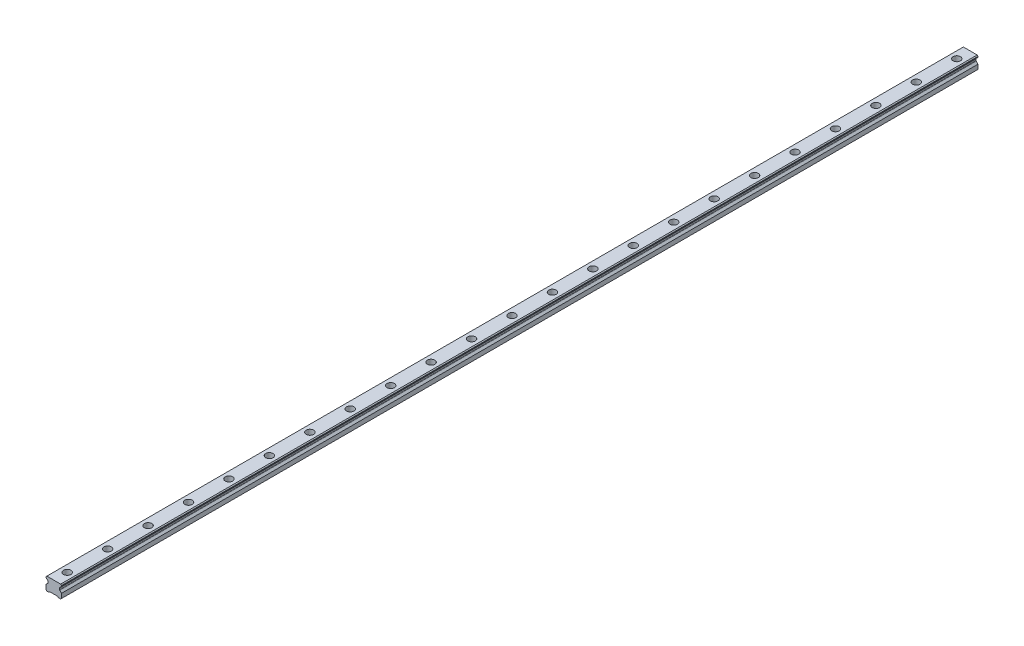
ISO-10303-21;
HEADER;
FILE_DESCRIPTION(('STEP AP214'),'2;1');
FILE_NAME('part.step','',(''),(''),'','','');
FILE_SCHEMA(('AUTOMOTIVE_DESIGN { 1 0 10303 214 1 1 1 1 }'));
ENDSEC;
DATA;
#1=APPLICATION_CONTEXT('core data for automotive mechanical design processes');
#2=APPLICATION_PROTOCOL_DEFINITION('international standard','automotive_design',2000,#1);
#3=PRODUCT_CONTEXT('',#1,'mechanical');
#4=PRODUCT('Part','Part','',(#3));
#5=PRODUCT_RELATED_PRODUCT_CATEGORY('part','',(#4));
#6=PRODUCT_DEFINITION_FORMATION('','',#4);
#7=PRODUCT_DEFINITION_CONTEXT('part definition',#1,'design');
#8=PRODUCT_DEFINITION('design','',#6,#7);
#9=PRODUCT_DEFINITION_SHAPE('','',#8);
#10=(LENGTH_UNIT() NAMED_UNIT(*) SI_UNIT(.MILLI.,.METRE.));
#11=(NAMED_UNIT(*) PLANE_ANGLE_UNIT() SI_UNIT($,.RADIAN.));
#12=(NAMED_UNIT(*) SI_UNIT($,.STERADIAN.) SOLID_ANGLE_UNIT());
#13=UNCERTAINTY_MEASURE_WITH_UNIT(LENGTH_MEASURE(1.E-05),#10,'distance_accuracy_value','');
#14=(GEOMETRIC_REPRESENTATION_CONTEXT(3) GLOBAL_UNCERTAINTY_ASSIGNED_CONTEXT((#13)) GLOBAL_UNIT_ASSIGNED_CONTEXT((#10,
#11,#12)) REPRESENTATION_CONTEXT('',''));
#15=CARTESIAN_POINT('',(0.,0.,0.));
#16=DIRECTION('',(0.,0.,1.));
#17=DIRECTION('',(1.,0.,0.));
#18=AXIS2_PLACEMENT_3D('',#15,#16,#17);
#19=CARTESIAN_POINT('',(0.,10.2,-660.));
#20=DIRECTION('',(0.,1.,0.));
#21=DIRECTION('',(0.,0.,1.));
#22=AXIS2_PLACEMENT_3D('',#19,#20,#21);
#23=PLANE('',#22);
#24=CARTESIAN_POINT('',(0.,10.2,-660.));
#25=DIRECTION('',(0.,1.,0.));
#26=DIRECTION('',(0.,0.,1.));
#27=AXIS2_PLACEMENT_3D('',#24,#25,#26);
#28=CIRCLE('',#27,3.5);
#29=CARTESIAN_POINT('',(0.,10.2,-656.5));
#30=VERTEX_POINT('',#29);
#31=EDGE_CURVE('E526',#30,#30,#28,.T.);
#32=ORIENTED_EDGE('',*,*,#31,.F.);
#33=EDGE_LOOP('',(#32));
#34=FACE_BOUND('',#33,.T.);
#35=CARTESIAN_POINT('',(0.,10.2,-660.));
#36=DIRECTION('',(0.,1.,0.));
#37=DIRECTION('',(0.,0.,1.));
#38=AXIS2_PLACEMENT_3D('',#35,#36,#37);
#39=CIRCLE('',#38,5.5);
#40=CARTESIAN_POINT('',(0.,10.2,-654.5));
#41=VERTEX_POINT('',#40);
#42=EDGE_CURVE('E11',#41,#41,#39,.T.);
#43=ORIENTED_EDGE('',*,*,#42,.T.);
#44=EDGE_LOOP('',(#43));
#45=FACE_BOUND('',#44,.T.);
#46=ADVANCED_FACE('F39',(#34,#45),#23,.T.);
#47=CARTESIAN_POINT('',(0.,10.2,-660.));
#48=DIRECTION('',(0.,1.,0.));
#49=DIRECTION('',(0.,0.,1.));
#50=AXIS2_PLACEMENT_3D('',#47,#48,#49);
#51=CYLINDRICAL_SURFACE('',#50,5.5);
#52=ORIENTED_EDGE('',*,*,#42,.F.);
#53=EDGE_LOOP('',(#52));
#54=FACE_BOUND('',#53,.T.);
#55=CARTESIAN_POINT('',(0.,19.2,-660.));
#56=DIRECTION('',(0.,1.,0.));
#57=DIRECTION('',(0.,0.,1.));
#58=AXIS2_PLACEMENT_3D('',#55,#56,#57);
#59=CIRCLE('',#58,5.5);
#60=CARTESIAN_POINT('',(0.,19.2,-654.5));
#61=VERTEX_POINT('',#60);
#62=EDGE_CURVE('E48',#61,#61,#59,.T.);
#63=ORIENTED_EDGE('',*,*,#62,.T.);
#64=EDGE_LOOP('',(#63));
#65=FACE_BOUND('',#64,.T.);
#66=ADVANCED_FACE('F904',(#54,#65),#51,.F.);
#67=CARTESIAN_POINT('',(0.,10.2,-600.));
#68=DIRECTION('',(0.,1.,0.));
#69=DIRECTION('',(0.,0.,1.));
#70=AXIS2_PLACEMENT_3D('',#67,#68,#69);
#71=PLANE('',#70);
#72=CARTESIAN_POINT('',(0.,10.2,-600.));
#73=DIRECTION('',(0.,1.,0.));
#74=DIRECTION('',(0.,0.,1.));
#75=AXIS2_PLACEMENT_3D('',#72,#73,#74);
#76=CIRCLE('',#75,3.5);
#77=CARTESIAN_POINT('',(0.,10.2,-596.5));
#78=VERTEX_POINT('',#77);
#79=EDGE_CURVE('E531',#78,#78,#76,.T.);
#80=ORIENTED_EDGE('',*,*,#79,.F.);
#81=EDGE_LOOP('',(#80));
#82=FACE_BOUND('',#81,.T.);
#83=CARTESIAN_POINT('',(0.,10.2,-600.));
#84=DIRECTION('',(0.,1.,0.));
#85=DIRECTION('',(0.,0.,1.));
#86=AXIS2_PLACEMENT_3D('',#83,#84,#85);
#87=CIRCLE('',#86,5.5);
#88=CARTESIAN_POINT('',(0.,10.2,-594.5));
#89=VERTEX_POINT('',#88);
#90=EDGE_CURVE('E510',#89,#89,#87,.T.);
#91=ORIENTED_EDGE('',*,*,#90,.T.);
#92=EDGE_LOOP('',(#91));
#93=FACE_BOUND('',#92,.T.);
#94=ADVANCED_FACE('F906',(#82,#93),#71,.T.);
#95=CARTESIAN_POINT('',(0.,10.2,-600.));
#96=DIRECTION('',(0.,1.,0.));
#97=DIRECTION('',(0.,0.,1.));
#98=AXIS2_PLACEMENT_3D('',#95,#96,#97);
#99=CYLINDRICAL_SURFACE('',#98,5.5);
#100=ORIENTED_EDGE('',*,*,#90,.F.);
#101=EDGE_LOOP('',(#100));
#102=FACE_BOUND('',#101,.T.);
#103=CARTESIAN_POINT('',(0.,19.2,-600.));
#104=DIRECTION('',(0.,1.,0.));
#105=DIRECTION('',(0.,0.,1.));
#106=AXIS2_PLACEMENT_3D('',#103,#104,#105);
#107=CIRCLE('',#106,5.5);
#108=CARTESIAN_POINT('',(0.,19.2,-594.5));
#109=VERTEX_POINT('',#108);
#110=EDGE_CURVE('E506',#109,#109,#107,.T.);
#111=ORIENTED_EDGE('',*,*,#110,.T.);
#112=EDGE_LOOP('',(#111));
#113=FACE_BOUND('',#112,.T.);
#114=ADVANCED_FACE('F912',(#102,#113),#99,.F.);
#115=CARTESIAN_POINT('',(0.,10.2,-540.));
#116=DIRECTION('',(0.,1.,0.));
#117=DIRECTION('',(0.,0.,1.));
#118=AXIS2_PLACEMENT_3D('',#115,#116,#117);
#119=PLANE('',#118);
#120=CARTESIAN_POINT('',(0.,10.2,-540.));
#121=DIRECTION('',(0.,1.,0.));
#122=DIRECTION('',(0.,0.,1.));
#123=AXIS2_PLACEMENT_3D('',#120,#121,#122);
#124=CIRCLE('',#123,3.5);
#125=CARTESIAN_POINT('',(0.,10.2,-536.5));
#126=VERTEX_POINT('',#125);
#127=EDGE_CURVE('E536',#126,#126,#124,.T.);
#128=ORIENTED_EDGE('',*,*,#127,.F.);
#129=EDGE_LOOP('',(#128));
#130=FACE_BOUND('',#129,.T.);
#131=CARTESIAN_POINT('',(0.,10.2,-540.));
#132=DIRECTION('',(0.,1.,0.));
#133=DIRECTION('',(0.,0.,1.));
#134=AXIS2_PLACEMENT_3D('',#131,#132,#133);
#135=CIRCLE('',#134,5.5);
#136=CARTESIAN_POINT('',(0.,10.2,-534.5));
#137=VERTEX_POINT('',#136);
#138=EDGE_CURVE('E502',#137,#137,#135,.T.);
#139=ORIENTED_EDGE('',*,*,#138,.T.);
#140=EDGE_LOOP('',(#139));
#141=FACE_BOUND('',#140,.T.);
#142=ADVANCED_FACE('F920',(#130,#141),#119,.T.);
#143=CARTESIAN_POINT('',(0.,10.2,-540.));
#144=DIRECTION('',(0.,1.,0.));
#145=DIRECTION('',(0.,0.,1.));
#146=AXIS2_PLACEMENT_3D('',#143,#144,#145);
#147=CYLINDRICAL_SURFACE('',#146,5.5);
#148=ORIENTED_EDGE('',*,*,#138,.F.);
#149=EDGE_LOOP('',(#148));
#150=FACE_BOUND('',#149,.T.);
#151=CARTESIAN_POINT('',(0.,19.2,-540.));
#152=DIRECTION('',(0.,1.,0.));
#153=DIRECTION('',(0.,0.,1.));
#154=AXIS2_PLACEMENT_3D('',#151,#152,#153);
#155=CIRCLE('',#154,5.5);
#156=CARTESIAN_POINT('',(0.,19.2,-534.5));
#157=VERTEX_POINT('',#156);
#158=EDGE_CURVE('E498',#157,#157,#155,.T.);
#159=ORIENTED_EDGE('',*,*,#158,.T.);
#160=EDGE_LOOP('',(#159));
#161=FACE_BOUND('',#160,.T.);
#162=ADVANCED_FACE('F924',(#150,#161),#147,.F.);
#163=CARTESIAN_POINT('',(0.,10.2,-480.));
#164=DIRECTION('',(0.,1.,0.));
#165=DIRECTION('',(0.,0.,1.));
#166=AXIS2_PLACEMENT_3D('',#163,#164,#165);
#167=PLANE('',#166);
#168=CARTESIAN_POINT('',(0.,10.2,-480.));
#169=DIRECTION('',(0.,1.,0.));
#170=DIRECTION('',(0.,0.,1.));
#171=AXIS2_PLACEMENT_3D('',#168,#169,#170);
#172=CIRCLE('',#171,3.5);
#173=CARTESIAN_POINT('',(0.,10.2,-476.5));
#174=VERTEX_POINT('',#173);
#175=EDGE_CURVE('E541',#174,#174,#172,.T.);
#176=ORIENTED_EDGE('',*,*,#175,.F.);
#177=EDGE_LOOP('',(#176));
#178=FACE_BOUND('',#177,.T.);
#179=CARTESIAN_POINT('',(0.,10.2,-480.));
#180=DIRECTION('',(0.,1.,0.));
#181=DIRECTION('',(0.,0.,1.));
#182=AXIS2_PLACEMENT_3D('',#179,#180,#181);
#183=CIRCLE('',#182,5.5);
#184=CARTESIAN_POINT('',(0.,10.2,-474.5));
#185=VERTEX_POINT('',#184);
#186=EDGE_CURVE('E494',#185,#185,#183,.T.);
#187=ORIENTED_EDGE('',*,*,#186,.T.);
#188=EDGE_LOOP('',(#187));
#189=FACE_BOUND('',#188,.T.);
#190=ADVANCED_FACE('F928',(#178,#189),#167,.T.);
#191=CARTESIAN_POINT('',(0.,10.2,-480.));
#192=DIRECTION('',(0.,1.,0.));
#193=DIRECTION('',(0.,0.,1.));
#194=AXIS2_PLACEMENT_3D('',#191,#192,#193);
#195=CYLINDRICAL_SURFACE('',#194,5.5);
#196=ORIENTED_EDGE('',*,*,#186,.F.);
#197=EDGE_LOOP('',(#196));
#198=FACE_BOUND('',#197,.T.);
#199=CARTESIAN_POINT('',(0.,19.2,-480.));
#200=DIRECTION('',(0.,1.,0.));
#201=DIRECTION('',(0.,0.,1.));
#202=AXIS2_PLACEMENT_3D('',#199,#200,#201);
#203=CIRCLE('',#202,5.5);
#204=CARTESIAN_POINT('',(0.,19.2,-474.5));
#205=VERTEX_POINT('',#204);
#206=EDGE_CURVE('E490',#205,#205,#203,.T.);
#207=ORIENTED_EDGE('',*,*,#206,.T.);
#208=EDGE_LOOP('',(#207));
#209=FACE_BOUND('',#208,.T.);
#210=ADVANCED_FACE('F932',(#198,#209),#195,.F.);
#211=CARTESIAN_POINT('',(0.,10.2,-420.));
#212=DIRECTION('',(0.,1.,0.));
#213=DIRECTION('',(0.,0.,1.));
#214=AXIS2_PLACEMENT_3D('',#211,#212,#213);
#215=PLANE('',#214);
#216=CARTESIAN_POINT('',(0.,10.2,-420.));
#217=DIRECTION('',(0.,1.,0.));
#218=DIRECTION('',(0.,0.,1.));
#219=AXIS2_PLACEMENT_3D('',#216,#217,#218);
#220=CIRCLE('',#219,3.5);
#221=CARTESIAN_POINT('',(0.,10.2,-416.5));
#222=VERTEX_POINT('',#221);
#223=EDGE_CURVE('E546',#222,#222,#220,.T.);
#224=ORIENTED_EDGE('',*,*,#223,.F.);
#225=EDGE_LOOP('',(#224));
#226=FACE_BOUND('',#225,.T.);
#227=CARTESIAN_POINT('',(0.,10.2,-420.));
#228=DIRECTION('',(0.,1.,0.));
#229=DIRECTION('',(0.,0.,1.));
#230=AXIS2_PLACEMENT_3D('',#227,#228,#229);
#231=CIRCLE('',#230,5.5);
#232=CARTESIAN_POINT('',(0.,10.2,-414.5));
#233=VERTEX_POINT('',#232);
#234=EDGE_CURVE('E486',#233,#233,#231,.T.);
#235=ORIENTED_EDGE('',*,*,#234,.T.);
#236=EDGE_LOOP('',(#235));
#237=FACE_BOUND('',#236,.T.);
#238=ADVANCED_FACE('F936',(#226,#237),#215,.T.);
#239=CARTESIAN_POINT('',(0.,10.2,-420.));
#240=DIRECTION('',(0.,1.,0.));
#241=DIRECTION('',(0.,0.,1.));
#242=AXIS2_PLACEMENT_3D('',#239,#240,#241);
#243=CYLINDRICAL_SURFACE('',#242,5.5);
#244=ORIENTED_EDGE('',*,*,#234,.F.);
#245=EDGE_LOOP('',(#244));
#246=FACE_BOUND('',#245,.T.);
#247=CARTESIAN_POINT('',(0.,19.2,-420.));
#248=DIRECTION('',(0.,1.,0.));
#249=DIRECTION('',(0.,0.,1.));
#250=AXIS2_PLACEMENT_3D('',#247,#248,#249);
#251=CIRCLE('',#250,5.5);
#252=CARTESIAN_POINT('',(0.,19.2,-414.5));
#253=VERTEX_POINT('',#252);
#254=EDGE_CURVE('E482',#253,#253,#251,.T.);
#255=ORIENTED_EDGE('',*,*,#254,.T.);
#256=EDGE_LOOP('',(#255));
#257=FACE_BOUND('',#256,.T.);
#258=ADVANCED_FACE('F940',(#246,#257),#243,.F.);
#259=CARTESIAN_POINT('',(0.,10.2,-360.));
#260=DIRECTION('',(0.,1.,0.));
#261=DIRECTION('',(0.,0.,1.));
#262=AXIS2_PLACEMENT_3D('',#259,#260,#261);
#263=PLANE('',#262);
#264=CARTESIAN_POINT('',(0.,10.2,-360.));
#265=DIRECTION('',(0.,1.,0.));
#266=DIRECTION('',(0.,0.,1.));
#267=AXIS2_PLACEMENT_3D('',#264,#265,#266);
#268=CIRCLE('',#267,3.5);
#269=CARTESIAN_POINT('',(0.,10.2,-356.5));
#270=VERTEX_POINT('',#269);
#271=EDGE_CURVE('E551',#270,#270,#268,.T.);
#272=ORIENTED_EDGE('',*,*,#271,.F.);
#273=EDGE_LOOP('',(#272));
#274=FACE_BOUND('',#273,.T.);
#275=CARTESIAN_POINT('',(0.,10.2,-360.));
#276=DIRECTION('',(0.,1.,0.));
#277=DIRECTION('',(0.,0.,1.));
#278=AXIS2_PLACEMENT_3D('',#275,#276,#277);
#279=CIRCLE('',#278,5.5);
#280=CARTESIAN_POINT('',(0.,10.2,-354.5));
#281=VERTEX_POINT('',#280);
#282=EDGE_CURVE('E478',#281,#281,#279,.T.);
#283=ORIENTED_EDGE('',*,*,#282,.T.);
#284=EDGE_LOOP('',(#283));
#285=FACE_BOUND('',#284,.T.);
#286=ADVANCED_FACE('F944',(#274,#285),#263,.T.);
#287=CARTESIAN_POINT('',(0.,10.2,-360.));
#288=DIRECTION('',(0.,1.,0.));
#289=DIRECTION('',(0.,0.,1.));
#290=AXIS2_PLACEMENT_3D('',#287,#288,#289);
#291=CYLINDRICAL_SURFACE('',#290,5.5);
#292=ORIENTED_EDGE('',*,*,#282,.F.);
#293=EDGE_LOOP('',(#292));
#294=FACE_BOUND('',#293,.T.);
#295=CARTESIAN_POINT('',(0.,19.2,-360.));
#296=DIRECTION('',(0.,1.,0.));
#297=DIRECTION('',(0.,0.,1.));
#298=AXIS2_PLACEMENT_3D('',#295,#296,#297);
#299=CIRCLE('',#298,5.5);
#300=CARTESIAN_POINT('',(0.,19.2,-354.5));
#301=VERTEX_POINT('',#300);
#302=EDGE_CURVE('E474',#301,#301,#299,.T.);
#303=ORIENTED_EDGE('',*,*,#302,.T.);
#304=EDGE_LOOP('',(#303));
#305=FACE_BOUND('',#304,.T.);
#306=ADVANCED_FACE('F948',(#294,#305),#291,.F.);
#307=CARTESIAN_POINT('',(0.,10.2,-300.));
#308=DIRECTION('',(0.,1.,0.));
#309=DIRECTION('',(0.,0.,1.));
#310=AXIS2_PLACEMENT_3D('',#307,#308,#309);
#311=PLANE('',#310);
#312=CARTESIAN_POINT('',(0.,10.2,-300.));
#313=DIRECTION('',(0.,1.,0.));
#314=DIRECTION('',(0.,0.,1.));
#315=AXIS2_PLACEMENT_3D('',#312,#313,#314);
#316=CIRCLE('',#315,3.5);
#317=CARTESIAN_POINT('',(0.,10.2,-296.5));
#318=VERTEX_POINT('',#317);
#319=EDGE_CURVE('E556',#318,#318,#316,.T.);
#320=ORIENTED_EDGE('',*,*,#319,.F.);
#321=EDGE_LOOP('',(#320));
#322=FACE_BOUND('',#321,.T.);
#323=CARTESIAN_POINT('',(0.,10.2,-300.));
#324=DIRECTION('',(0.,1.,0.));
#325=DIRECTION('',(0.,0.,1.));
#326=AXIS2_PLACEMENT_3D('',#323,#324,#325);
#327=CIRCLE('',#326,5.5);
#328=CARTESIAN_POINT('',(0.,10.2,-294.5));
#329=VERTEX_POINT('',#328);
#330=EDGE_CURVE('E470',#329,#329,#327,.T.);
#331=ORIENTED_EDGE('',*,*,#330,.T.);
#332=EDGE_LOOP('',(#331));
#333=FACE_BOUND('',#332,.T.);
#334=ADVANCED_FACE('F952',(#322,#333),#311,.T.);
#335=CARTESIAN_POINT('',(0.,10.2,-300.));
#336=DIRECTION('',(0.,1.,0.));
#337=DIRECTION('',(0.,0.,1.));
#338=AXIS2_PLACEMENT_3D('',#335,#336,#337);
#339=CYLINDRICAL_SURFACE('',#338,5.5);
#340=ORIENTED_EDGE('',*,*,#330,.F.);
#341=EDGE_LOOP('',(#340));
#342=FACE_BOUND('',#341,.T.);
#343=CARTESIAN_POINT('',(0.,19.2,-300.));
#344=DIRECTION('',(0.,1.,0.));
#345=DIRECTION('',(0.,0.,1.));
#346=AXIS2_PLACEMENT_3D('',#343,#344,#345);
#347=CIRCLE('',#346,5.5);
#348=CARTESIAN_POINT('',(0.,19.2,-294.5));
#349=VERTEX_POINT('',#348);
#350=EDGE_CURVE('E466',#349,#349,#347,.T.);
#351=ORIENTED_EDGE('',*,*,#350,.T.);
#352=EDGE_LOOP('',(#351));
#353=FACE_BOUND('',#352,.T.);
#354=ADVANCED_FACE('F956',(#342,#353),#339,.F.);
#355=CARTESIAN_POINT('',(0.,10.2,-240.));
#356=DIRECTION('',(0.,1.,0.));
#357=DIRECTION('',(0.,0.,1.));
#358=AXIS2_PLACEMENT_3D('',#355,#356,#357);
#359=PLANE('',#358);
#360=CARTESIAN_POINT('',(0.,10.2,-240.));
#361=DIRECTION('',(0.,1.,0.));
#362=DIRECTION('',(0.,0.,1.));
#363=AXIS2_PLACEMENT_3D('',#360,#361,#362);
#364=CIRCLE('',#363,3.5);
#365=CARTESIAN_POINT('',(0.,10.2,-236.5));
#366=VERTEX_POINT('',#365);
#367=EDGE_CURVE('E561',#366,#366,#364,.T.);
#368=ORIENTED_EDGE('',*,*,#367,.F.);
#369=EDGE_LOOP('',(#368));
#370=FACE_BOUND('',#369,.T.);
#371=CARTESIAN_POINT('',(0.,10.2,-240.));
#372=DIRECTION('',(0.,1.,0.));
#373=DIRECTION('',(0.,0.,1.));
#374=AXIS2_PLACEMENT_3D('',#371,#372,#373);
#375=CIRCLE('',#374,5.5);
#376=CARTESIAN_POINT('',(0.,10.2,-234.5));
#377=VERTEX_POINT('',#376);
#378=EDGE_CURVE('E462',#377,#377,#375,.T.);
#379=ORIENTED_EDGE('',*,*,#378,.T.);
#380=EDGE_LOOP('',(#379));
#381=FACE_BOUND('',#380,.T.);
#382=ADVANCED_FACE('F960',(#370,#381),#359,.T.);
#383=CARTESIAN_POINT('',(0.,10.2,-240.));
#384=DIRECTION('',(0.,1.,0.));
#385=DIRECTION('',(0.,0.,1.));
#386=AXIS2_PLACEMENT_3D('',#383,#384,#385);
#387=CYLINDRICAL_SURFACE('',#386,5.5);
#388=ORIENTED_EDGE('',*,*,#378,.F.);
#389=EDGE_LOOP('',(#388));
#390=FACE_BOUND('',#389,.T.);
#391=CARTESIAN_POINT('',(0.,19.2,-240.));
#392=DIRECTION('',(0.,1.,0.));
#393=DIRECTION('',(0.,0.,1.));
#394=AXIS2_PLACEMENT_3D('',#391,#392,#393);
#395=CIRCLE('',#394,5.5);
#396=CARTESIAN_POINT('',(0.,19.2,-234.5));
#397=VERTEX_POINT('',#396);
#398=EDGE_CURVE('E458',#397,#397,#395,.T.);
#399=ORIENTED_EDGE('',*,*,#398,.T.);
#400=EDGE_LOOP('',(#399));
#401=FACE_BOUND('',#400,.T.);
#402=ADVANCED_FACE('F964',(#390,#401),#387,.F.);
#403=CARTESIAN_POINT('',(0.,10.2,-180.));
#404=DIRECTION('',(0.,1.,0.));
#405=DIRECTION('',(0.,0.,1.));
#406=AXIS2_PLACEMENT_3D('',#403,#404,#405);
#407=PLANE('',#406);
#408=CARTESIAN_POINT('',(0.,10.2,-180.));
#409=DIRECTION('',(0.,1.,0.));
#410=DIRECTION('',(0.,0.,1.));
#411=AXIS2_PLACEMENT_3D('',#408,#409,#410);
#412=CIRCLE('',#411,3.5);
#413=CARTESIAN_POINT('',(0.,10.2,-176.5));
#414=VERTEX_POINT('',#413);
#415=EDGE_CURVE('E566',#414,#414,#412,.T.);
#416=ORIENTED_EDGE('',*,*,#415,.F.);
#417=EDGE_LOOP('',(#416));
#418=FACE_BOUND('',#417,.T.);
#419=CARTESIAN_POINT('',(0.,10.2,-180.));
#420=DIRECTION('',(0.,1.,0.));
#421=DIRECTION('',(0.,0.,1.));
#422=AXIS2_PLACEMENT_3D('',#419,#420,#421);
#423=CIRCLE('',#422,5.5);
#424=CARTESIAN_POINT('',(0.,10.2,-174.5));
#425=VERTEX_POINT('',#424);
#426=EDGE_CURVE('E454',#425,#425,#423,.T.);
#427=ORIENTED_EDGE('',*,*,#426,.T.);
#428=EDGE_LOOP('',(#427));
#429=FACE_BOUND('',#428,.T.);
#430=ADVANCED_FACE('F968',(#418,#429),#407,.T.);
#431=CARTESIAN_POINT('',(0.,10.2,-180.));
#432=DIRECTION('',(0.,1.,0.));
#433=DIRECTION('',(0.,0.,1.));
#434=AXIS2_PLACEMENT_3D('',#431,#432,#433);
#435=CYLINDRICAL_SURFACE('',#434,5.5);
#436=ORIENTED_EDGE('',*,*,#426,.F.);
#437=EDGE_LOOP('',(#436));
#438=FACE_BOUND('',#437,.T.);
#439=CARTESIAN_POINT('',(0.,19.2,-180.));
#440=DIRECTION('',(0.,1.,0.));
#441=DIRECTION('',(0.,0.,1.));
#442=AXIS2_PLACEMENT_3D('',#439,#440,#441);
#443=CIRCLE('',#442,5.5);
#444=CARTESIAN_POINT('',(0.,19.2,-174.5));
#445=VERTEX_POINT('',#444);
#446=EDGE_CURVE('E450',#445,#445,#443,.T.);
#447=ORIENTED_EDGE('',*,*,#446,.T.);
#448=EDGE_LOOP('',(#447));
#449=FACE_BOUND('',#448,.T.);
#450=ADVANCED_FACE('F972',(#438,#449),#435,.F.);
#451=CARTESIAN_POINT('',(0.,10.2,-120.));
#452=DIRECTION('',(0.,1.,0.));
#453=DIRECTION('',(0.,0.,1.));
#454=AXIS2_PLACEMENT_3D('',#451,#452,#453);
#455=PLANE('',#454);
#456=CARTESIAN_POINT('',(0.,10.2,-120.));
#457=DIRECTION('',(0.,1.,0.));
#458=DIRECTION('',(0.,0.,1.));
#459=AXIS2_PLACEMENT_3D('',#456,#457,#458);
#460=CIRCLE('',#459,3.5);
#461=CARTESIAN_POINT('',(0.,10.2,-116.5));
#462=VERTEX_POINT('',#461);
#463=EDGE_CURVE('E571',#462,#462,#460,.T.);
#464=ORIENTED_EDGE('',*,*,#463,.F.);
#465=EDGE_LOOP('',(#464));
#466=FACE_BOUND('',#465,.T.);
#467=CARTESIAN_POINT('',(0.,10.2,-120.));
#468=DIRECTION('',(0.,1.,0.));
#469=DIRECTION('',(0.,0.,1.));
#470=AXIS2_PLACEMENT_3D('',#467,#468,#469);
#471=CIRCLE('',#470,5.5);
#472=CARTESIAN_POINT('',(0.,10.2,-114.5));
#473=VERTEX_POINT('',#472);
#474=EDGE_CURVE('E446',#473,#473,#471,.T.);
#475=ORIENTED_EDGE('',*,*,#474,.T.);
#476=EDGE_LOOP('',(#475));
#477=FACE_BOUND('',#476,.T.);
#478=ADVANCED_FACE('F976',(#466,#477),#455,.T.);
#479=CARTESIAN_POINT('',(0.,10.2,-120.));
#480=DIRECTION('',(0.,1.,0.));
#481=DIRECTION('',(0.,0.,1.));
#482=AXIS2_PLACEMENT_3D('',#479,#480,#481);
#483=CYLINDRICAL_SURFACE('',#482,5.5);
#484=ORIENTED_EDGE('',*,*,#474,.F.);
#485=EDGE_LOOP('',(#484));
#486=FACE_BOUND('',#485,.T.);
#487=CARTESIAN_POINT('',(0.,19.2,-120.));
#488=DIRECTION('',(0.,1.,0.));
#489=DIRECTION('',(0.,0.,1.));
#490=AXIS2_PLACEMENT_3D('',#487,#488,#489);
#491=CIRCLE('',#490,5.5);
#492=CARTESIAN_POINT('',(0.,19.2,-114.5));
#493=VERTEX_POINT('',#492);
#494=EDGE_CURVE('E442',#493,#493,#491,.T.);
#495=ORIENTED_EDGE('',*,*,#494,.T.);
#496=EDGE_LOOP('',(#495));
#497=FACE_BOUND('',#496,.T.);
#498=ADVANCED_FACE('F980',(#486,#497),#483,.F.);
#499=CARTESIAN_POINT('',(0.,10.2,-59.9999999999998));
#500=DIRECTION('',(0.,1.,0.));
#501=DIRECTION('',(0.,0.,1.));
#502=AXIS2_PLACEMENT_3D('',#499,#500,#501);
#503=PLANE('',#502);
#504=CARTESIAN_POINT('',(0.,10.2,-59.9999999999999));
#505=DIRECTION('',(0.,1.,0.));
#506=DIRECTION('',(0.,0.,1.));
#507=AXIS2_PLACEMENT_3D('',#504,#505,#506);
#508=CIRCLE('',#507,3.5);
#509=CARTESIAN_POINT('',(0.,10.2,-56.4999999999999));
#510=VERTEX_POINT('',#509);
#511=EDGE_CURVE('E576',#510,#510,#508,.T.);
#512=ORIENTED_EDGE('',*,*,#511,.F.);
#513=EDGE_LOOP('',(#512));
#514=FACE_BOUND('',#513,.T.);
#515=CARTESIAN_POINT('',(0.,10.2,-59.9999999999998));
#516=DIRECTION('',(0.,1.,0.));
#517=DIRECTION('',(0.,0.,1.));
#518=AXIS2_PLACEMENT_3D('',#515,#516,#517);
#519=CIRCLE('',#518,5.5);
#520=CARTESIAN_POINT('',(0.,10.2,-54.4999999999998));
#521=VERTEX_POINT('',#520);
#522=EDGE_CURVE('E438',#521,#521,#519,.T.);
#523=ORIENTED_EDGE('',*,*,#522,.T.);
#524=EDGE_LOOP('',(#523));
#525=FACE_BOUND('',#524,.T.);
#526=ADVANCED_FACE('F984',(#514,#525),#503,.T.);
#527=CARTESIAN_POINT('',(0.,10.2,-59.9999999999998));
#528=DIRECTION('',(0.,1.,0.));
#529=DIRECTION('',(0.,0.,1.));
#530=AXIS2_PLACEMENT_3D('',#527,#528,#529);
#531=CYLINDRICAL_SURFACE('',#530,5.5);
#532=ORIENTED_EDGE('',*,*,#522,.F.);
#533=EDGE_LOOP('',(#532));
#534=FACE_BOUND('',#533,.T.);
#535=CARTESIAN_POINT('',(0.,19.2,-59.9999999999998));
#536=DIRECTION('',(0.,1.,0.));
#537=DIRECTION('',(0.,0.,1.));
#538=AXIS2_PLACEMENT_3D('',#535,#536,#537);
#539=CIRCLE('',#538,5.5);
#540=CARTESIAN_POINT('',(0.,19.2,-54.4999999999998));
#541=VERTEX_POINT('',#540);
#542=EDGE_CURVE('E434',#541,#541,#539,.T.);
#543=ORIENTED_EDGE('',*,*,#542,.T.);
#544=EDGE_LOOP('',(#543));
#545=FACE_BOUND('',#544,.T.);
#546=ADVANCED_FACE('F988',(#534,#545),#531,.F.);
#547=CARTESIAN_POINT('',(0.,10.2,2.22044604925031E-13));
#548=DIRECTION('',(0.,1.,0.));
#549=DIRECTION('',(0.,0.,1.));
#550=AXIS2_PLACEMENT_3D('',#547,#548,#549);
#551=PLANE('',#550);
#552=CARTESIAN_POINT('',(0.,10.2,1.11022302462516E-13));
#553=DIRECTION('',(0.,1.,0.));
#554=DIRECTION('',(0.,0.,1.));
#555=AXIS2_PLACEMENT_3D('',#552,#553,#554);
#556=CIRCLE('',#555,3.5);
#557=CARTESIAN_POINT('',(0.,10.2,3.50000000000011));
#558=VERTEX_POINT('',#557);
#559=EDGE_CURVE('E581',#558,#558,#556,.T.);
#560=ORIENTED_EDGE('',*,*,#559,.F.);
#561=EDGE_LOOP('',(#560));
#562=FACE_BOUND('',#561,.T.);
#563=CARTESIAN_POINT('',(0.,10.2,2.22044604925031E-13));
#564=DIRECTION('',(0.,1.,0.));
#565=DIRECTION('',(0.,0.,1.));
#566=AXIS2_PLACEMENT_3D('',#563,#564,#565);
#567=CIRCLE('',#566,5.5);
#568=CARTESIAN_POINT('',(0.,10.2,5.50000000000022));
#569=VERTEX_POINT('',#568);
#570=EDGE_CURVE('E430',#569,#569,#567,.T.);
#571=ORIENTED_EDGE('',*,*,#570,.T.);
#572=EDGE_LOOP('',(#571));
#573=FACE_BOUND('',#572,.T.);
#574=ADVANCED_FACE('F992',(#562,#573),#551,.T.);
#575=CARTESIAN_POINT('',(0.,10.2,2.22044604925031E-13));
#576=DIRECTION('',(0.,1.,0.));
#577=DIRECTION('',(0.,0.,1.));
#578=AXIS2_PLACEMENT_3D('',#575,#576,#577);
#579=CYLINDRICAL_SURFACE('',#578,5.5);
#580=ORIENTED_EDGE('',*,*,#570,.F.);
#581=EDGE_LOOP('',(#580));
#582=FACE_BOUND('',#581,.T.);
#583=CARTESIAN_POINT('',(0.,19.2,2.22044604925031E-13));
#584=DIRECTION('',(0.,1.,0.));
#585=DIRECTION('',(0.,0.,1.));
#586=AXIS2_PLACEMENT_3D('',#583,#584,#585);
#587=CIRCLE('',#586,5.5);
#588=CARTESIAN_POINT('',(0.,19.2,5.50000000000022));
#589=VERTEX_POINT('',#588);
#590=EDGE_CURVE('E426',#589,#589,#587,.T.);
#591=ORIENTED_EDGE('',*,*,#590,.T.);
#592=EDGE_LOOP('',(#591));
#593=FACE_BOUND('',#592,.T.);
#594=ADVANCED_FACE('F996',(#582,#593),#579,.F.);
#595=CARTESIAN_POINT('',(0.,10.2,60.0000000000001));
#596=DIRECTION('',(0.,1.,0.));
#597=DIRECTION('',(0.,0.,1.));
#598=AXIS2_PLACEMENT_3D('',#595,#596,#597);
#599=PLANE('',#598);
#600=CARTESIAN_POINT('',(0.,10.2,60.0000000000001));
#601=DIRECTION('',(0.,1.,0.));
#602=DIRECTION('',(0.,0.,1.));
#603=AXIS2_PLACEMENT_3D('',#600,#601,#602);
#604=CIRCLE('',#603,3.5);
#605=CARTESIAN_POINT('',(0.,10.2,63.5000000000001));
#606=VERTEX_POINT('',#605);
#607=EDGE_CURVE('E586',#606,#606,#604,.T.);
#608=ORIENTED_EDGE('',*,*,#607,.F.);
#609=EDGE_LOOP('',(#608));
#610=FACE_BOUND('',#609,.T.);
#611=CARTESIAN_POINT('',(0.,10.2,60.0000000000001));
#612=DIRECTION('',(0.,1.,0.));
#613=DIRECTION('',(0.,0.,1.));
#614=AXIS2_PLACEMENT_3D('',#611,#612,#613);
#615=CIRCLE('',#614,5.5);
#616=CARTESIAN_POINT('',(0.,10.2,65.5000000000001));
#617=VERTEX_POINT('',#616);
#618=EDGE_CURVE('E422',#617,#617,#615,.T.);
#619=ORIENTED_EDGE('',*,*,#618,.T.);
#620=EDGE_LOOP('',(#619));
#621=FACE_BOUND('',#620,.T.);
#622=ADVANCED_FACE('F1000',(#610,#621),#599,.T.);
#623=CARTESIAN_POINT('',(0.,10.2,60.0000000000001));
#624=DIRECTION('',(0.,1.,0.));
#625=DIRECTION('',(0.,0.,1.));
#626=AXIS2_PLACEMENT_3D('',#623,#624,#625);
#627=CYLINDRICAL_SURFACE('',#626,5.5);
#628=ORIENTED_EDGE('',*,*,#618,.F.);
#629=EDGE_LOOP('',(#628));
#630=FACE_BOUND('',#629,.T.);
#631=CARTESIAN_POINT('',(0.,19.2,60.0000000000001));
#632=DIRECTION('',(0.,1.,0.));
#633=DIRECTION('',(0.,0.,1.));
#634=AXIS2_PLACEMENT_3D('',#631,#632,#633);
#635=CIRCLE('',#634,5.5);
#636=CARTESIAN_POINT('',(0.,19.2,65.5000000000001));
#637=VERTEX_POINT('',#636);
#638=EDGE_CURVE('E418',#637,#637,#635,.T.);
#639=ORIENTED_EDGE('',*,*,#638,.T.);
#640=EDGE_LOOP('',(#639));
#641=FACE_BOUND('',#640,.T.);
#642=ADVANCED_FACE('F1004',(#630,#641),#627,.F.);
#643=CARTESIAN_POINT('',(0.,10.2,120.));
#644=DIRECTION('',(0.,1.,0.));
#645=DIRECTION('',(0.,0.,1.));
#646=AXIS2_PLACEMENT_3D('',#643,#644,#645);
#647=PLANE('',#646);
#648=CARTESIAN_POINT('',(0.,10.2,120.));
#649=DIRECTION('',(0.,1.,0.));
#650=DIRECTION('',(0.,0.,1.));
#651=AXIS2_PLACEMENT_3D('',#648,#649,#650);
#652=CIRCLE('',#651,3.5);
#653=CARTESIAN_POINT('',(0.,10.2,123.5));
#654=VERTEX_POINT('',#653);
#655=EDGE_CURVE('E591',#654,#654,#652,.T.);
#656=ORIENTED_EDGE('',*,*,#655,.F.);
#657=EDGE_LOOP('',(#656));
#658=FACE_BOUND('',#657,.T.);
#659=CARTESIAN_POINT('',(0.,10.2,120.));
#660=DIRECTION('',(0.,1.,0.));
#661=DIRECTION('',(0.,0.,1.));
#662=AXIS2_PLACEMENT_3D('',#659,#660,#661);
#663=CIRCLE('',#662,5.5);
#664=CARTESIAN_POINT('',(0.,10.2,125.5));
#665=VERTEX_POINT('',#664);
#666=EDGE_CURVE('E414',#665,#665,#663,.T.);
#667=ORIENTED_EDGE('',*,*,#666,.T.);
#668=EDGE_LOOP('',(#667));
#669=FACE_BOUND('',#668,.T.);
#670=ADVANCED_FACE('F1008',(#658,#669),#647,.T.);
#671=CARTESIAN_POINT('',(0.,10.2,120.));
#672=DIRECTION('',(0.,1.,0.));
#673=DIRECTION('',(0.,0.,1.));
#674=AXIS2_PLACEMENT_3D('',#671,#672,#673);
#675=CYLINDRICAL_SURFACE('',#674,5.5);
#676=ORIENTED_EDGE('',*,*,#666,.F.);
#677=EDGE_LOOP('',(#676));
#678=FACE_BOUND('',#677,.T.);
#679=CARTESIAN_POINT('',(0.,19.2,120.));
#680=DIRECTION('',(0.,1.,0.));
#681=DIRECTION('',(0.,0.,1.));
#682=AXIS2_PLACEMENT_3D('',#679,#680,#681);
#683=CIRCLE('',#682,5.5);
#684=CARTESIAN_POINT('',(0.,19.2,125.5));
#685=VERTEX_POINT('',#684);
#686=EDGE_CURVE('E410',#685,#685,#683,.T.);
#687=ORIENTED_EDGE('',*,*,#686,.T.);
#688=EDGE_LOOP('',(#687));
#689=FACE_BOUND('',#688,.T.);
#690=ADVANCED_FACE('F1012',(#678,#689),#675,.F.);
#691=CARTESIAN_POINT('',(0.,10.2,180.));
#692=DIRECTION('',(0.,1.,0.));
#693=DIRECTION('',(0.,0.,1.));
#694=AXIS2_PLACEMENT_3D('',#691,#692,#693);
#695=PLANE('',#694);
#696=CARTESIAN_POINT('',(0.,10.2,180.));
#697=DIRECTION('',(0.,1.,0.));
#698=DIRECTION('',(0.,0.,1.));
#699=AXIS2_PLACEMENT_3D('',#696,#697,#698);
#700=CIRCLE('',#699,3.5);
#701=CARTESIAN_POINT('',(0.,10.2,183.5));
#702=VERTEX_POINT('',#701);
#703=EDGE_CURVE('E596',#702,#702,#700,.T.);
#704=ORIENTED_EDGE('',*,*,#703,.F.);
#705=EDGE_LOOP('',(#704));
#706=FACE_BOUND('',#705,.T.);
#707=CARTESIAN_POINT('',(0.,10.2,180.));
#708=DIRECTION('',(0.,1.,0.));
#709=DIRECTION('',(0.,0.,1.));
#710=AXIS2_PLACEMENT_3D('',#707,#708,#709);
#711=CIRCLE('',#710,5.5);
#712=CARTESIAN_POINT('',(0.,10.2,185.5));
#713=VERTEX_POINT('',#712);
#714=EDGE_CURVE('E406',#713,#713,#711,.T.);
#715=ORIENTED_EDGE('',*,*,#714,.T.);
#716=EDGE_LOOP('',(#715));
#717=FACE_BOUND('',#716,.T.);
#718=ADVANCED_FACE('F1016',(#706,#717),#695,.T.);
#719=CARTESIAN_POINT('',(0.,10.2,180.));
#720=DIRECTION('',(0.,1.,0.));
#721=DIRECTION('',(0.,0.,1.));
#722=AXIS2_PLACEMENT_3D('',#719,#720,#721);
#723=CYLINDRICAL_SURFACE('',#722,5.5);
#724=ORIENTED_EDGE('',*,*,#714,.F.);
#725=EDGE_LOOP('',(#724));
#726=FACE_BOUND('',#725,.T.);
#727=CARTESIAN_POINT('',(0.,19.2,180.));
#728=DIRECTION('',(0.,1.,0.));
#729=DIRECTION('',(0.,0.,1.));
#730=AXIS2_PLACEMENT_3D('',#727,#728,#729);
#731=CIRCLE('',#730,5.5);
#732=CARTESIAN_POINT('',(0.,19.2,185.5));
#733=VERTEX_POINT('',#732);
#734=EDGE_CURVE('E402',#733,#733,#731,.T.);
#735=ORIENTED_EDGE('',*,*,#734,.T.);
#736=EDGE_LOOP('',(#735));
#737=FACE_BOUND('',#736,.T.);
#738=ADVANCED_FACE('F1020',(#726,#737),#723,.F.);
#739=CARTESIAN_POINT('',(0.,10.2,240.));
#740=DIRECTION('',(0.,1.,0.));
#741=DIRECTION('',(0.,0.,1.));
#742=AXIS2_PLACEMENT_3D('',#739,#740,#741);
#743=PLANE('',#742);
#744=CARTESIAN_POINT('',(0.,10.2,240.));
#745=DIRECTION('',(0.,1.,0.));
#746=DIRECTION('',(0.,0.,1.));
#747=AXIS2_PLACEMENT_3D('',#744,#745,#746);
#748=CIRCLE('',#747,3.5);
#749=CARTESIAN_POINT('',(0.,10.2,243.5));
#750=VERTEX_POINT('',#749);
#751=EDGE_CURVE('E601',#750,#750,#748,.T.);
#752=ORIENTED_EDGE('',*,*,#751,.F.);
#753=EDGE_LOOP('',(#752));
#754=FACE_BOUND('',#753,.T.);
#755=CARTESIAN_POINT('',(0.,10.2,240.));
#756=DIRECTION('',(0.,1.,0.));
#757=DIRECTION('',(0.,0.,1.));
#758=AXIS2_PLACEMENT_3D('',#755,#756,#757);
#759=CIRCLE('',#758,5.5);
#760=CARTESIAN_POINT('',(0.,10.2,245.5));
#761=VERTEX_POINT('',#760);
#762=EDGE_CURVE('E398',#761,#761,#759,.T.);
#763=ORIENTED_EDGE('',*,*,#762,.T.);
#764=EDGE_LOOP('',(#763));
#765=FACE_BOUND('',#764,.T.);
#766=ADVANCED_FACE('F1024',(#754,#765),#743,.T.);
#767=CARTESIAN_POINT('',(0.,10.2,240.));
#768=DIRECTION('',(0.,1.,0.));
#769=DIRECTION('',(0.,0.,1.));
#770=AXIS2_PLACEMENT_3D('',#767,#768,#769);
#771=CYLINDRICAL_SURFACE('',#770,5.5);
#772=ORIENTED_EDGE('',*,*,#762,.F.);
#773=EDGE_LOOP('',(#772));
#774=FACE_BOUND('',#773,.T.);
#775=CARTESIAN_POINT('',(0.,19.2,240.));
#776=DIRECTION('',(0.,1.,0.));
#777=DIRECTION('',(0.,0.,1.));
#778=AXIS2_PLACEMENT_3D('',#775,#776,#777);
#779=CIRCLE('',#778,5.5);
#780=CARTESIAN_POINT('',(0.,19.2,245.5));
#781=VERTEX_POINT('',#780);
#782=EDGE_CURVE('E394',#781,#781,#779,.T.);
#783=ORIENTED_EDGE('',*,*,#782,.T.);
#784=EDGE_LOOP('',(#783));
#785=FACE_BOUND('',#784,.T.);
#786=ADVANCED_FACE('F856',(#774,#785),#771,.F.);
#787=CARTESIAN_POINT('',(0.,10.2,300.));
#788=DIRECTION('',(0.,1.,0.));
#789=DIRECTION('',(0.,0.,1.));
#790=AXIS2_PLACEMENT_3D('',#787,#788,#789);
#791=PLANE('',#790);
#792=CARTESIAN_POINT('',(0.,10.2,300.));
#793=DIRECTION('',(0.,1.,0.));
#794=DIRECTION('',(0.,0.,1.));
#795=AXIS2_PLACEMENT_3D('',#792,#793,#794);
#796=CIRCLE('',#795,3.5);
#797=CARTESIAN_POINT('',(0.,10.2,303.5));
#798=VERTEX_POINT('',#797);
#799=EDGE_CURVE('E606',#798,#798,#796,.T.);
#800=ORIENTED_EDGE('',*,*,#799,.F.);
#801=EDGE_LOOP('',(#800));
#802=FACE_BOUND('',#801,.T.);
#803=CARTESIAN_POINT('',(0.,10.2,300.));
#804=DIRECTION('',(0.,1.,0.));
#805=DIRECTION('',(0.,0.,1.));
#806=AXIS2_PLACEMENT_3D('',#803,#804,#805);
#807=CIRCLE('',#806,5.5);
#808=CARTESIAN_POINT('',(0.,10.2,305.5));
#809=VERTEX_POINT('',#808);
#810=EDGE_CURVE('E390',#809,#809,#807,.T.);
#811=ORIENTED_EDGE('',*,*,#810,.T.);
#812=EDGE_LOOP('',(#811));
#813=FACE_BOUND('',#812,.T.);
#814=ADVANCED_FACE('F852',(#802,#813),#791,.T.);
#815=CARTESIAN_POINT('',(0.,10.2,300.));
#816=DIRECTION('',(0.,1.,0.));
#817=DIRECTION('',(0.,0.,1.));
#818=AXIS2_PLACEMENT_3D('',#815,#816,#817);
#819=CYLINDRICAL_SURFACE('',#818,5.5);
#820=ORIENTED_EDGE('',*,*,#810,.F.);
#821=EDGE_LOOP('',(#820));
#822=FACE_BOUND('',#821,.T.);
#823=CARTESIAN_POINT('',(0.,19.2,300.));
#824=DIRECTION('',(0.,1.,0.));
#825=DIRECTION('',(0.,0.,1.));
#826=AXIS2_PLACEMENT_3D('',#823,#824,#825);
#827=CIRCLE('',#826,5.5);
#828=CARTESIAN_POINT('',(0.,19.2,305.5));
#829=VERTEX_POINT('',#828);
#830=EDGE_CURVE('E386',#829,#829,#827,.T.);
#831=ORIENTED_EDGE('',*,*,#830,.T.);
#832=EDGE_LOOP('',(#831));
#833=FACE_BOUND('',#832,.T.);
#834=ADVANCED_FACE('F855',(#822,#833),#819,.F.);
#835=CARTESIAN_POINT('',(0.,10.2,360.));
#836=DIRECTION('',(0.,1.,0.));
#837=DIRECTION('',(0.,0.,1.));
#838=AXIS2_PLACEMENT_3D('',#835,#836,#837);
#839=PLANE('',#838);
#840=CARTESIAN_POINT('',(0.,10.2,360.));
#841=DIRECTION('',(0.,1.,0.));
#842=DIRECTION('',(0.,0.,1.));
#843=AXIS2_PLACEMENT_3D('',#840,#841,#842);
#844=CIRCLE('',#843,3.5);
#845=CARTESIAN_POINT('',(0.,10.2,363.5));
#846=VERTEX_POINT('',#845);
#847=EDGE_CURVE('E611',#846,#846,#844,.T.);
#848=ORIENTED_EDGE('',*,*,#847,.F.);
#849=EDGE_LOOP('',(#848));
#850=FACE_BOUND('',#849,.T.);
#851=CARTESIAN_POINT('',(0.,10.2,360.));
#852=DIRECTION('',(0.,1.,0.));
#853=DIRECTION('',(0.,0.,1.));
#854=AXIS2_PLACEMENT_3D('',#851,#852,#853);
#855=CIRCLE('',#854,5.5);
#856=CARTESIAN_POINT('',(0.,10.2,365.5));
#857=VERTEX_POINT('',#856);
#858=EDGE_CURVE('E382',#857,#857,#855,.T.);
#859=ORIENTED_EDGE('',*,*,#858,.T.);
#860=EDGE_LOOP('',(#859));
#861=FACE_BOUND('',#860,.T.);
#862=ADVANCED_FACE('F862',(#850,#861),#839,.T.);
#863=CARTESIAN_POINT('',(0.,10.2,360.));
#864=DIRECTION('',(0.,1.,0.));
#865=DIRECTION('',(0.,0.,1.));
#866=AXIS2_PLACEMENT_3D('',#863,#864,#865);
#867=CYLINDRICAL_SURFACE('',#866,5.5);
#868=ORIENTED_EDGE('',*,*,#858,.F.);
#869=EDGE_LOOP('',(#868));
#870=FACE_BOUND('',#869,.T.);
#871=CARTESIAN_POINT('',(0.,19.2,360.));
#872=DIRECTION('',(0.,1.,0.));
#873=DIRECTION('',(0.,0.,1.));
#874=AXIS2_PLACEMENT_3D('',#871,#872,#873);
#875=CIRCLE('',#874,5.5);
#876=CARTESIAN_POINT('',(0.,19.2,365.5));
#877=VERTEX_POINT('',#876);
#878=EDGE_CURVE('E378',#877,#877,#875,.T.);
#879=ORIENTED_EDGE('',*,*,#878,.T.);
#880=EDGE_LOOP('',(#879));
#881=FACE_BOUND('',#880,.T.);
#882=ADVANCED_FACE('F1034',(#870,#881),#867,.F.);
#883=CARTESIAN_POINT('',(0.,10.2,420.));
#884=DIRECTION('',(0.,1.,0.));
#885=DIRECTION('',(0.,0.,1.));
#886=AXIS2_PLACEMENT_3D('',#883,#884,#885);
#887=PLANE('',#886);
#888=CARTESIAN_POINT('',(0.,10.2,420.));
#889=DIRECTION('',(0.,1.,0.));
#890=DIRECTION('',(0.,0.,1.));
#891=AXIS2_PLACEMENT_3D('',#888,#889,#890);
#892=CIRCLE('',#891,3.5);
#893=CARTESIAN_POINT('',(0.,10.2,423.5));
#894=VERTEX_POINT('',#893);
#895=EDGE_CURVE('E615',#894,#894,#892,.T.);
#896=ORIENTED_EDGE('',*,*,#895,.F.);
#897=EDGE_LOOP('',(#896));
#898=FACE_BOUND('',#897,.T.);
#899=CARTESIAN_POINT('',(0.,10.2,420.));
#900=DIRECTION('',(0.,1.,0.));
#901=DIRECTION('',(0.,0.,1.));
#902=AXIS2_PLACEMENT_3D('',#899,#900,#901);
#903=CIRCLE('',#902,5.5);
#904=CARTESIAN_POINT('',(0.,10.2,425.5));
#905=VERTEX_POINT('',#904);
#906=EDGE_CURVE('E374',#905,#905,#903,.T.);
#907=ORIENTED_EDGE('',*,*,#906,.T.);
#908=EDGE_LOOP('',(#907));
#909=FACE_BOUND('',#908,.T.);
#910=ADVANCED_FACE('F1038',(#898,#909),#887,.T.);
#911=CARTESIAN_POINT('',(0.,10.2,420.));
#912=DIRECTION('',(0.,1.,0.));
#913=DIRECTION('',(0.,0.,1.));
#914=AXIS2_PLACEMENT_3D('',#911,#912,#913);
#915=CYLINDRICAL_SURFACE('',#914,5.5);
#916=ORIENTED_EDGE('',*,*,#906,.F.);
#917=EDGE_LOOP('',(#916));
#918=FACE_BOUND('',#917,.T.);
#919=CARTESIAN_POINT('',(0.,19.2,420.));
#920=DIRECTION('',(0.,1.,0.));
#921=DIRECTION('',(0.,0.,1.));
#922=AXIS2_PLACEMENT_3D('',#919,#920,#921);
#923=CIRCLE('',#922,5.5);
#924=CARTESIAN_POINT('',(0.,19.2,425.5));
#925=VERTEX_POINT('',#924);
#926=EDGE_CURVE('E370',#925,#925,#923,.T.);
#927=ORIENTED_EDGE('',*,*,#926,.T.);
#928=EDGE_LOOP('',(#927));
#929=FACE_BOUND('',#928,.T.);
#930=ADVANCED_FACE('F1042',(#918,#929),#915,.F.);
#931=CARTESIAN_POINT('',(0.,10.2,480.));
#932=DIRECTION('',(0.,1.,0.));
#933=DIRECTION('',(0.,0.,1.));
#934=AXIS2_PLACEMENT_3D('',#931,#932,#933);
#935=PLANE('',#934);
#936=CARTESIAN_POINT('',(0.,10.2,480.));
#937=DIRECTION('',(0.,1.,0.));
#938=DIRECTION('',(0.,0.,1.));
#939=AXIS2_PLACEMENT_3D('',#936,#937,#938);
#940=CIRCLE('',#939,3.5);
#941=CARTESIAN_POINT('',(0.,10.2,483.5));
#942=VERTEX_POINT('',#941);
#943=EDGE_CURVE('E619',#942,#942,#940,.T.);
#944=ORIENTED_EDGE('',*,*,#943,.F.);
#945=EDGE_LOOP('',(#944));
#946=FACE_BOUND('',#945,.T.);
#947=CARTESIAN_POINT('',(0.,10.2,480.));
#948=DIRECTION('',(0.,1.,0.));
#949=DIRECTION('',(0.,0.,1.));
#950=AXIS2_PLACEMENT_3D('',#947,#948,#949);
#951=CIRCLE('',#950,5.5);
#952=CARTESIAN_POINT('',(0.,10.2,485.5));
#953=VERTEX_POINT('',#952);
#954=EDGE_CURVE('E366',#953,#953,#951,.T.);
#955=ORIENTED_EDGE('',*,*,#954,.T.);
#956=EDGE_LOOP('',(#955));
#957=FACE_BOUND('',#956,.T.);
#958=ADVANCED_FACE('F1046',(#946,#957),#935,.T.);
#959=CARTESIAN_POINT('',(0.,10.2,480.));
#960=DIRECTION('',(0.,1.,0.));
#961=DIRECTION('',(0.,0.,1.));
#962=AXIS2_PLACEMENT_3D('',#959,#960,#961);
#963=CYLINDRICAL_SURFACE('',#962,5.5);
#964=ORIENTED_EDGE('',*,*,#954,.F.);
#965=EDGE_LOOP('',(#964));
#966=FACE_BOUND('',#965,.T.);
#967=CARTESIAN_POINT('',(0.,19.2,480.));
#968=DIRECTION('',(0.,1.,0.));
#969=DIRECTION('',(0.,0.,1.));
#970=AXIS2_PLACEMENT_3D('',#967,#968,#969);
#971=CIRCLE('',#970,5.5);
#972=CARTESIAN_POINT('',(0.,19.2,485.5));
#973=VERTEX_POINT('',#972);
#974=EDGE_CURVE('E362',#973,#973,#971,.T.);
#975=ORIENTED_EDGE('',*,*,#974,.T.);
#976=EDGE_LOOP('',(#975));
#977=FACE_BOUND('',#976,.T.);
#978=ADVANCED_FACE('F1050',(#966,#977),#963,.F.);
#979=CARTESIAN_POINT('',(0.,10.2,540.));
#980=DIRECTION('',(0.,1.,0.));
#981=DIRECTION('',(0.,0.,1.));
#982=AXIS2_PLACEMENT_3D('',#979,#980,#981);
#983=PLANE('',#982);
#984=CARTESIAN_POINT('',(0.,10.2,540.));
#985=DIRECTION('',(0.,1.,0.));
#986=DIRECTION('',(0.,0.,1.));
#987=AXIS2_PLACEMENT_3D('',#984,#985,#986);
#988=CIRCLE('',#987,3.5);
#989=CARTESIAN_POINT('',(0.,10.2,543.5));
#990=VERTEX_POINT('',#989);
#991=EDGE_CURVE('E633',#990,#990,#988,.T.);
#992=ORIENTED_EDGE('',*,*,#991,.F.);
#993=EDGE_LOOP('',(#992));
#994=FACE_BOUND('',#993,.T.);
#995=CARTESIAN_POINT('',(0.,10.2,540.));
#996=DIRECTION('',(0.,1.,0.));
#997=DIRECTION('',(0.,0.,1.));
#998=AXIS2_PLACEMENT_3D('',#995,#996,#997);
#999=CIRCLE('',#998,5.5);
#1000=CARTESIAN_POINT('',(0.,10.2,545.5));
#1001=VERTEX_POINT('',#1000);
#1002=EDGE_CURVE('E358',#1001,#1001,#999,.T.);
#1003=ORIENTED_EDGE('',*,*,#1002,.T.);
#1004=EDGE_LOOP('',(#1003));
#1005=FACE_BOUND('',#1004,.T.);
#1006=ADVANCED_FACE('F1054',(#994,#1005),#983,.T.);
#1007=CARTESIAN_POINT('',(0.,10.2,540.));
#1008=DIRECTION('',(0.,1.,0.));
#1009=DIRECTION('',(0.,0.,1.));
#1010=AXIS2_PLACEMENT_3D('',#1007,#1008,#1009);
#1011=CYLINDRICAL_SURFACE('',#1010,5.5);
#1012=ORIENTED_EDGE('',*,*,#1002,.F.);
#1013=EDGE_LOOP('',(#1012));
#1014=FACE_BOUND('',#1013,.T.);
#1015=CARTESIAN_POINT('',(0.,19.2,540.));
#1016=DIRECTION('',(0.,1.,0.));
#1017=DIRECTION('',(0.,0.,1.));
#1018=AXIS2_PLACEMENT_3D('',#1015,#1016,#1017);
#1019=CIRCLE('',#1018,5.5);
#1020=CARTESIAN_POINT('',(0.,19.2,545.5));
#1021=VERTEX_POINT('',#1020);
#1022=EDGE_CURVE('E354',#1021,#1021,#1019,.T.);
#1023=ORIENTED_EDGE('',*,*,#1022,.T.);
#1024=EDGE_LOOP('',(#1023));
#1025=FACE_BOUND('',#1024,.T.);
#1026=ADVANCED_FACE('F1058',(#1014,#1025),#1011,.F.);
#1027=CARTESIAN_POINT('',(11.5,0.,680.));
#1028=DIRECTION('',(0.,1.,0.));
#1029=DIRECTION('',(-1.,0.,0.));
#1030=AXIS2_PLACEMENT_3D('',#1027,#1028,#1029);
#1031=PLANE('',#1030);
#1032=DIRECTION('',(1.,0.,0.));
#1033=VECTOR('',#1032,1.);
#1034=CARTESIAN_POINT('',(11.5,0.,-680.));
#1035=LINE('',#1034,#1033);
#1036=CARTESIAN_POINT('',(-10.25,0.,-680.));
#1037=VERTEX_POINT('',#1036);
#1038=CARTESIAN_POINT('',(-7.,0.,-680.));
#1039=VERTEX_POINT('',#1038);
#1040=EDGE_CURVE('E229',#1037,#1039,#1035,.T.);
#1041=ORIENTED_EDGE('',*,*,#1040,.T.);
#1042=DIRECTION('',(0.,0.,1.));
#1043=VECTOR('',#1042,1.);
#1044=CARTESIAN_POINT('',(-7.,0.,-680.));
#1045=LINE('',#1044,#1043);
#1046=CARTESIAN_POINT('',(-7.,0.,680.));
#1047=VERTEX_POINT('',#1046);
#1048=EDGE_CURVE('E674',#1039,#1047,#1045,.T.);
#1049=ORIENTED_EDGE('',*,*,#1048,.T.);
#1050=DIRECTION('',(1.,0.,0.));
#1051=VECTOR('',#1050,1.);
#1052=CARTESIAN_POINT('',(11.5,0.,680.));
#1053=LINE('',#1052,#1051);
#1054=CARTESIAN_POINT('',(-10.25,0.,680.));
#1055=VERTEX_POINT('',#1054);
#1056=EDGE_CURVE('E743',#1055,#1047,#1053,.T.);
#1057=ORIENTED_EDGE('',*,*,#1056,.F.);
#1058=DIRECTION('',(0.,0.,-1.));
#1059=VECTOR('',#1058,1.);
#1060=CARTESIAN_POINT('',(-10.25,0.,680.));
#1061=LINE('',#1060,#1059);
#1062=EDGE_CURVE('E289',#1055,#1037,#1061,.T.);
#1063=ORIENTED_EDGE('',*,*,#1062,.T.);
#1064=EDGE_LOOP('',(#1041,#1049,#1057,#1063));
#1065=FACE_BOUND('',#1064,.T.);
#1066=ADVANCED_FACE('F806',(#1065),#1031,.F.);
#1067=CARTESIAN_POINT('',(-11.5,19.2,680.));
#1068=DIRECTION('',(1.,0.,0.));
#1069=DIRECTION('',(0.,1.,0.));
#1070=AXIS2_PLACEMENT_3D('',#1067,#1068,#1069);
#1071=PLANE('',#1070);
#1072=DIRECTION('',(0.,-1.,0.));
#1073=VECTOR('',#1072,1.);
#1074=CARTESIAN_POINT('',(-11.5,19.2,680.));
#1075=LINE('',#1074,#1073);
#1076=CARTESIAN_POINT('',(-11.5,17.9500000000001,680.));
#1077=VERTEX_POINT('',#1076);
#1078=CARTESIAN_POINT('',(-11.5,16.7,680.));
#1079=VERTEX_POINT('',#1078);
#1080=EDGE_CURVE('E739',#1077,#1079,#1075,.T.);
#1081=ORIENTED_EDGE('',*,*,#1080,.F.);
#1082=DIRECTION('',(0.,0.,-1.));
#1083=VECTOR('',#1082,1.);
#1084=CARTESIAN_POINT('',(-11.5,17.9500000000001,680.));
#1085=LINE('',#1084,#1083);
#1086=CARTESIAN_POINT('',(-11.5,17.9500000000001,-680.));
#1087=VERTEX_POINT('',#1086);
#1088=EDGE_CURVE('E251',#1077,#1087,#1085,.T.);
#1089=ORIENTED_EDGE('',*,*,#1088,.T.);
#1090=DIRECTION('',(0.,-1.,0.));
#1091=VECTOR('',#1090,1.);
#1092=CARTESIAN_POINT('',(-11.5,19.2,-680.));
#1093=LINE('',#1092,#1091);
#1094=CARTESIAN_POINT('',(-11.5,16.7,-680.));
#1095=VERTEX_POINT('',#1094);
#1096=EDGE_CURVE('E230',#1087,#1095,#1093,.T.);
#1097=ORIENTED_EDGE('',*,*,#1096,.T.);
#1098=DIRECTION('',(0.,0.,1.));
#1099=VECTOR('',#1098,1.);
#1100=CARTESIAN_POINT('',(-11.5,16.7,-680.));
#1101=LINE('',#1100,#1099);
#1102=EDGE_CURVE('E694',#1095,#1079,#1101,.T.);
#1103=ORIENTED_EDGE('',*,*,#1102,.T.);
#1104=EDGE_LOOP('',(#1081,#1089,#1097,#1103));
#1105=FACE_BOUND('',#1104,.T.);
#1106=ADVANCED_FACE('F768',(#1105),#1071,.F.);
#1107=CARTESIAN_POINT('',(11.5,19.2,680.));
#1108=DIRECTION('',(-1.,0.,0.));
#1109=DIRECTION('',(0.,0.,1.));
#1110=AXIS2_PLACEMENT_3D('',#1107,#1108,#1109);
#1111=PLANE('',#1110);
#1112=DIRECTION('',(0.,1.,0.));
#1113=VECTOR('',#1112,1.);
#1114=CARTESIAN_POINT('',(11.5,19.2,680.));
#1115=LINE('',#1114,#1113);
#1116=CARTESIAN_POINT('',(11.5,1.24999999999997,680.));
#1117=VERTEX_POINT('',#1116);
#1118=CARTESIAN_POINT('',(11.5,7.95,680.));
#1119=VERTEX_POINT('',#1118);
#1120=EDGE_CURVE('E748',#1117,#1119,#1115,.T.);
#1121=ORIENTED_EDGE('',*,*,#1120,.F.);
#1122=DIRECTION('',(0.,0.,-1.));
#1123=VECTOR('',#1122,1.);
#1124=CARTESIAN_POINT('',(11.5,1.24999999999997,680.));
#1125=LINE('',#1124,#1123);
#1126=CARTESIAN_POINT('',(11.5,1.24999999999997,-680.));
#1127=VERTEX_POINT('',#1126);
#1128=EDGE_CURVE('E296',#1117,#1127,#1125,.T.);
#1129=ORIENTED_EDGE('',*,*,#1128,.T.);
#1130=DIRECTION('',(0.,1.,0.));
#1131=VECTOR('',#1130,1.);
#1132=CARTESIAN_POINT('',(11.5,19.2,-680.));
#1133=LINE('',#1132,#1131);
#1134=CARTESIAN_POINT('',(11.5,7.95,-680.));
#1135=VERTEX_POINT('',#1134);
#1136=EDGE_CURVE('E243',#1127,#1135,#1133,.T.);
#1137=ORIENTED_EDGE('',*,*,#1136,.T.);
#1138=DIRECTION('',(0.,0.,1.));
#1139=VECTOR('',#1138,1.);
#1140=CARTESIAN_POINT('',(11.5,7.95,-680.));
#1141=LINE('',#1140,#1139);
#1142=EDGE_CURVE('E724',#1135,#1119,#1141,.T.);
#1143=ORIENTED_EDGE('',*,*,#1142,.T.);
#1144=EDGE_LOOP('',(#1121,#1129,#1137,#1143));
#1145=FACE_BOUND('',#1144,.T.);
#1146=ADVANCED_FACE('F1090',(#1145),#1111,.F.);
#1147=CARTESIAN_POINT('',(-11.5,7.95,-680.));
#1148=VERTEX_POINT('',#1147);
#1149=CARTESIAN_POINT('',(-11.5,1.24999999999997,-680.));
#1150=VERTEX_POINT('',#1149);
#1151=EDGE_CURVE('E239',#1148,#1150,#1093,.T.);
#1152=ORIENTED_EDGE('',*,*,#1151,.T.);
#1153=DIRECTION('',(0.,0.,1.));
#1154=VECTOR('',#1153,1.);
#1155=CARTESIAN_POINT('',(-11.5,1.24999999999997,680.));
#1156=LINE('',#1155,#1154);
#1157=CARTESIAN_POINT('',(-11.5,1.24999999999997,680.));
#1158=VERTEX_POINT('',#1157);
#1159=EDGE_CURVE('E293',#1150,#1158,#1156,.T.);
#1160=ORIENTED_EDGE('',*,*,#1159,.T.);
#1161=CARTESIAN_POINT('',(-11.5,7.95,680.));
#1162=VERTEX_POINT('',#1161);
#1163=EDGE_CURVE('E250',#1162,#1158,#1075,.T.);
#1164=ORIENTED_EDGE('',*,*,#1163,.F.);
#1165=DIRECTION('',(0.,0.,1.));
#1166=VECTOR('',#1165,1.);
#1167=CARTESIAN_POINT('',(-11.5,7.95,-680.));
#1168=LINE('',#1167,#1166);
#1169=EDGE_CURVE('E706',#1148,#1162,#1168,.T.);
#1170=ORIENTED_EDGE('',*,*,#1169,.F.);
#1171=EDGE_LOOP('',(#1152,#1160,#1164,#1170));
#1172=FACE_BOUND('',#1171,.T.);
#1173=ADVANCED_FACE('F796',(#1172),#1071,.F.);
#1174=CARTESIAN_POINT('',(7.,0.,680.));
#1175=VERTEX_POINT('',#1174);
#1176=CARTESIAN_POINT('',(10.25,0.,680.));
#1177=VERTEX_POINT('',#1176);
#1178=EDGE_CURVE('E219',#1175,#1177,#1053,.T.);
#1179=ORIENTED_EDGE('',*,*,#1178,.F.);
#1180=DIRECTION('',(0.,0.,1.));
#1181=VECTOR('',#1180,1.);
#1182=CARTESIAN_POINT('',(7.,0.,-680.));
#1183=LINE('',#1182,#1181);
#1184=CARTESIAN_POINT('',(7.,0.,-680.));
#1185=VERTEX_POINT('',#1184);
#1186=EDGE_CURVE('E206',#1185,#1175,#1183,.T.);
#1187=ORIENTED_EDGE('',*,*,#1186,.F.);
#1188=CARTESIAN_POINT('',(10.25,0.,-680.));
#1189=VERTEX_POINT('',#1188);
#1190=EDGE_CURVE('E217',#1185,#1189,#1035,.T.);
#1191=ORIENTED_EDGE('',*,*,#1190,.T.);
#1192=DIRECTION('',(0.,0.,1.));
#1193=VECTOR('',#1192,1.);
#1194=CARTESIAN_POINT('',(10.25,0.,680.));
#1195=LINE('',#1194,#1193);
#1196=EDGE_CURVE('E286',#1189,#1177,#1195,.T.);
#1197=ORIENTED_EDGE('',*,*,#1196,.T.);
#1198=EDGE_LOOP('',(#1179,#1187,#1191,#1197));
#1199=FACE_BOUND('',#1198,.T.);
#1200=ADVANCED_FACE('F215',(#1199),#1031,.F.);
#1201=CARTESIAN_POINT('',(11.5,16.7,-680.));
#1202=VERTEX_POINT('',#1201);
#1203=CARTESIAN_POINT('',(11.5,17.95,-680.));
#1204=VERTEX_POINT('',#1203);
#1205=EDGE_CURVE('E236',#1202,#1204,#1133,.T.);
#1206=ORIENTED_EDGE('',*,*,#1205,.T.);
#1207=DIRECTION('',(0.,0.,1.));
#1208=VECTOR('',#1207,1.);
#1209=CARTESIAN_POINT('',(11.5,17.95,680.));
#1210=LINE('',#1209,#1208);
#1211=CARTESIAN_POINT('',(11.5,17.95,680.));
#1212=VERTEX_POINT('',#1211);
#1213=EDGE_CURVE('E300',#1204,#1212,#1210,.T.);
#1214=ORIENTED_EDGE('',*,*,#1213,.T.);
#1215=CARTESIAN_POINT('',(11.5,16.7,680.));
#1216=VERTEX_POINT('',#1215);
#1217=EDGE_CURVE('E747',#1216,#1212,#1115,.T.);
#1218=ORIENTED_EDGE('',*,*,#1217,.F.);
#1219=DIRECTION('',(0.,0.,1.));
#1220=VECTOR('',#1219,1.);
#1221=CARTESIAN_POINT('',(11.5,16.7,-680.));
#1222=LINE('',#1221,#1220);
#1223=EDGE_CURVE('E699',#1202,#1216,#1222,.T.);
#1224=ORIENTED_EDGE('',*,*,#1223,.F.);
#1225=EDGE_LOOP('',(#1206,#1214,#1218,#1224));
#1226=FACE_BOUND('',#1225,.T.);
#1227=ADVANCED_FACE('F869',(#1226),#1111,.F.);
#1228=CARTESIAN_POINT('',(11.5,19.2,680.));
#1229=DIRECTION('',(0.,-1.,0.));
#1230=DIRECTION('',(0.,0.,-1.));
#1231=AXIS2_PLACEMENT_3D('',#1228,#1229,#1230);
#1232=PLANE('',#1231);
#1233=CARTESIAN_POINT('',(0.,19.2,600.));
#1234=DIRECTION('',(0.,1.,0.));
#1235=DIRECTION('',(0.,0.,1.));
#1236=AXIS2_PLACEMENT_3D('',#1233,#1234,#1235);
#1237=CIRCLE('',#1236,5.5);
#1238=CARTESIAN_POINT('',(0.,19.2,605.5));
#1239=VERTEX_POINT('',#1238);
#1240=EDGE_CURVE('E637',#1239,#1239,#1237,.T.);
#1241=ORIENTED_EDGE('',*,*,#1240,.F.);
#1242=EDGE_LOOP('',(#1241));
#1243=FACE_BOUND('',#1242,.T.);
#1244=CARTESIAN_POINT('',(0.,19.2,660.));
#1245=DIRECTION('',(0.,1.,0.));
#1246=DIRECTION('',(0.,0.,1.));
#1247=AXIS2_PLACEMENT_3D('',#1244,#1245,#1246);
#1248=CIRCLE('',#1247,5.5);
#1249=CARTESIAN_POINT('',(0.,19.2,665.5));
#1250=VERTEX_POINT('',#1249);
#1251=EDGE_CURVE('E653',#1250,#1250,#1248,.T.);
#1252=ORIENTED_EDGE('',*,*,#1251,.F.);
#1253=EDGE_LOOP('',(#1252));
#1254=FACE_BOUND('',#1253,.T.);
#1255=DIRECTION('',(-1.,0.,0.));
#1256=VECTOR('',#1255,1.);
#1257=CARTESIAN_POINT('',(11.5,19.2,-680.));
#1258=LINE('',#1257,#1256);
#1259=CARTESIAN_POINT('',(10.25,19.2,-680.));
#1260=VERTEX_POINT('',#1259);
#1261=CARTESIAN_POINT('',(-10.2500000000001,19.2,-680.));
#1262=VERTEX_POINT('',#1261);
#1263=EDGE_CURVE('E246',#1260,#1262,#1258,.T.);
#1264=ORIENTED_EDGE('',*,*,#1263,.T.);
#1265=DIRECTION('',(0.,0.,1.));
#1266=VECTOR('',#1265,1.);
#1267=CARTESIAN_POINT('',(-10.2500000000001,19.2,680.));
#1268=LINE('',#1267,#1266);
#1269=CARTESIAN_POINT('',(-10.2500000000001,19.2,680.));
#1270=VERTEX_POINT('',#1269);
#1271=EDGE_CURVE('E271',#1262,#1270,#1268,.T.);
#1272=ORIENTED_EDGE('',*,*,#1271,.T.);
#1273=DIRECTION('',(-1.,0.,0.));
#1274=VECTOR('',#1273,1.);
#1275=CARTESIAN_POINT('',(11.5,19.2,680.));
#1276=LINE('',#1275,#1274);
#1277=CARTESIAN_POINT('',(10.25,19.2,680.));
#1278=VERTEX_POINT('',#1277);
#1279=EDGE_CURVE('E256',#1278,#1270,#1276,.T.);
#1280=ORIENTED_EDGE('',*,*,#1279,.F.);
#1281=DIRECTION('',(0.,0.,-1.));
#1282=VECTOR('',#1281,1.);
#1283=CARTESIAN_POINT('',(10.25,19.2,680.));
#1284=LINE('',#1283,#1282);
#1285=EDGE_CURVE('E267',#1278,#1260,#1284,.T.);
#1286=ORIENTED_EDGE('',*,*,#1285,.T.);
#1287=EDGE_LOOP('',(#1264,#1272,#1280,#1286));
#1288=FACE_BOUND('',#1287,.T.);
#1289=ORIENTED_EDGE('',*,*,#1022,.F.);
#1290=EDGE_LOOP('',(#1289));
#1291=FACE_BOUND('',#1290,.T.);
#1292=ORIENTED_EDGE('',*,*,#974,.F.);
#1293=EDGE_LOOP('',(#1292));
#1294=FACE_BOUND('',#1293,.T.);
#1295=ORIENTED_EDGE('',*,*,#926,.F.);
#1296=EDGE_LOOP('',(#1295));
#1297=FACE_BOUND('',#1296,.T.);
#1298=ORIENTED_EDGE('',*,*,#878,.F.);
#1299=EDGE_LOOP('',(#1298));
#1300=FACE_BOUND('',#1299,.T.);
#1301=ORIENTED_EDGE('',*,*,#830,.F.);
#1302=EDGE_LOOP('',(#1301));
#1303=FACE_BOUND('',#1302,.T.);
#1304=ORIENTED_EDGE('',*,*,#782,.F.);
#1305=EDGE_LOOP('',(#1304));
#1306=FACE_BOUND('',#1305,.T.);
#1307=ORIENTED_EDGE('',*,*,#734,.F.);
#1308=EDGE_LOOP('',(#1307));
#1309=FACE_BOUND('',#1308,.T.);
#1310=ORIENTED_EDGE('',*,*,#686,.F.);
#1311=EDGE_LOOP('',(#1310));
#1312=FACE_BOUND('',#1311,.T.);
#1313=ORIENTED_EDGE('',*,*,#638,.F.);
#1314=EDGE_LOOP('',(#1313));
#1315=FACE_BOUND('',#1314,.T.);
#1316=ORIENTED_EDGE('',*,*,#590,.F.);
#1317=EDGE_LOOP('',(#1316));
#1318=FACE_BOUND('',#1317,.T.);
#1319=ORIENTED_EDGE('',*,*,#542,.F.);
#1320=EDGE_LOOP('',(#1319));
#1321=FACE_BOUND('',#1320,.T.);
#1322=ORIENTED_EDGE('',*,*,#494,.F.);
#1323=EDGE_LOOP('',(#1322));
#1324=FACE_BOUND('',#1323,.T.);
#1325=ORIENTED_EDGE('',*,*,#446,.F.);
#1326=EDGE_LOOP('',(#1325));
#1327=FACE_BOUND('',#1326,.T.);
#1328=ORIENTED_EDGE('',*,*,#398,.F.);
#1329=EDGE_LOOP('',(#1328));
#1330=FACE_BOUND('',#1329,.T.);
#1331=ORIENTED_EDGE('',*,*,#350,.F.);
#1332=EDGE_LOOP('',(#1331));
#1333=FACE_BOUND('',#1332,.T.);
#1334=ORIENTED_EDGE('',*,*,#302,.F.);
#1335=EDGE_LOOP('',(#1334));
#1336=FACE_BOUND('',#1335,.T.);
#1337=ORIENTED_EDGE('',*,*,#254,.F.);
#1338=EDGE_LOOP('',(#1337));
#1339=FACE_BOUND('',#1338,.T.);
#1340=ORIENTED_EDGE('',*,*,#206,.F.);
#1341=EDGE_LOOP('',(#1340));
#1342=FACE_BOUND('',#1341,.T.);
#1343=ORIENTED_EDGE('',*,*,#158,.F.);
#1344=EDGE_LOOP('',(#1343));
#1345=FACE_BOUND('',#1344,.T.);
#1346=ORIENTED_EDGE('',*,*,#110,.F.);
#1347=EDGE_LOOP('',(#1346));
#1348=FACE_BOUND('',#1347,.T.);
#1349=ORIENTED_EDGE('',*,*,#62,.F.);
#1350=EDGE_LOOP('',(#1349));
#1351=FACE_BOUND('',#1350,.T.);
#1352=ADVANCED_FACE('F866',(#1243,#1254,#1288,#1291,#1294,#1297,#1300,#1303,#1306,#1309,#1312,
#1315,#1318,#1321,#1324,#1327,#1330,#1333,#1336,#1339,#1342,#1345,#1348,#1351),#1232,.F.);
#1353=CARTESIAN_POINT('',(0.,0.,680.));
#1354=DIRECTION('',(0.,0.,-1.));
#1355=DIRECTION('',(-1.,0.,0.));
#1356=AXIS2_PLACEMENT_3D('',#1353,#1354,#1355);
#1357=PLANE('',#1356);
#1358=ORIENTED_EDGE('',*,*,#1056,.T.);
#1359=DIRECTION('',(-0.707106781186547,-0.707106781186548,0.));
#1360=VECTOR('',#1359,1.);
#1361=CARTESIAN_POINT('',(-7.,0.,680.));
#1362=LINE('',#1361,#1360);
#1363=CARTESIAN_POINT('',(-5.75,1.25,680.));
#1364=VERTEX_POINT('',#1363);
#1365=EDGE_CURVE('E211',#1364,#1047,#1362,.T.);
#1366=ORIENTED_EDGE('',*,*,#1365,.F.);
#1367=DIRECTION('',(-1.,0.,0.));
#1368=VECTOR('',#1367,1.);
#1369=CARTESIAN_POINT('',(-5.75,1.25,680.));
#1370=LINE('',#1369,#1368);
#1371=CARTESIAN_POINT('',(5.75,1.25,680.));
#1372=VERTEX_POINT('',#1371);
#1373=EDGE_CURVE('E668',#1372,#1364,#1370,.T.);
#1374=ORIENTED_EDGE('',*,*,#1373,.F.);
#1375=DIRECTION('',(-0.707106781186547,0.707106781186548,0.));
#1376=VECTOR('',#1375,1.);
#1377=CARTESIAN_POINT('',(5.75,1.25,680.));
#1378=LINE('',#1377,#1376);
#1379=EDGE_CURVE('E658',#1175,#1372,#1378,.T.);
#1380=ORIENTED_EDGE('',*,*,#1379,.F.);
#1381=ORIENTED_EDGE('',*,*,#1178,.T.);
#1382=DIRECTION('',(-0.707106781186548,-0.707106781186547,0.));
#1383=VECTOR('',#1382,1.);
#1384=CARTESIAN_POINT('',(11.5,1.24999999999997,680.));
#1385=LINE('',#1384,#1383);
#1386=EDGE_CURVE('E277',#1177,#1117,#1385,.F.);
#1387=ORIENTED_EDGE('',*,*,#1386,.T.);
#1388=ORIENTED_EDGE('',*,*,#1120,.T.);
#1389=DIRECTION('',(0.707106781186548,-0.707106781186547,0.));
#1390=VECTOR('',#1389,1.);
#1391=CARTESIAN_POINT('',(11.5,7.95,680.));
#1392=LINE('',#1391,#1390);
#1393=CARTESIAN_POINT('',(8.94944985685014,10.5005501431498,680.));
#1394=VERTEX_POINT('',#1393);
#1395=EDGE_CURVE('E678',#1394,#1119,#1392,.T.);
#1396=ORIENTED_EDGE('',*,*,#1395,.F.);
#1397=CARTESIAN_POINT('',(9.83333333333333,11.384433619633,680.));
#1398=DIRECTION('',(0.,0.,-1.));
#1399=DIRECTION('',(-1.,0.,0.));
#1400=AXIS2_PLACEMENT_3D('',#1397,#1398,#1399);
#1401=CIRCLE('',#1400,1.25);
#1402=CARTESIAN_POINT('',(8.58333333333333,11.384433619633,680.));
#1403=VERTEX_POINT('',#1402);
#1404=EDGE_CURVE('E331',#1394,#1403,#1401,.T.);
#1405=ORIENTED_EDGE('',*,*,#1404,.T.);
#1406=DIRECTION('',(0.,-1.,0.));
#1407=VECTOR('',#1406,1.);
#1408=CARTESIAN_POINT('',(8.58333333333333,10.8666666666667,680.));
#1409=LINE('',#1408,#1407);
#1410=CARTESIAN_POINT('',(8.58333333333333,13.265566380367,680.));
#1411=VERTEX_POINT('',#1410);
#1412=EDGE_CURVE('E716',#1411,#1403,#1409,.T.);
#1413=ORIENTED_EDGE('',*,*,#1412,.F.);
#1414=CARTESIAN_POINT('',(9.83333333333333,13.265566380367,680.));
#1415=DIRECTION('',(0.,0.,-1.));
#1416=DIRECTION('',(-1.,0.,0.));
#1417=AXIS2_PLACEMENT_3D('',#1414,#1415,#1416);
#1418=CIRCLE('',#1417,1.25);
#1419=CARTESIAN_POINT('',(8.94944985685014,14.1494498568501,680.));
#1420=VERTEX_POINT('',#1419);
#1421=EDGE_CURVE('E337',#1411,#1420,#1418,.T.);
#1422=ORIENTED_EDGE('',*,*,#1421,.T.);
#1423=DIRECTION('',(-0.707106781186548,-0.707106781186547,0.));
#1424=VECTOR('',#1423,1.);
#1425=CARTESIAN_POINT('',(8.58333333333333,13.7833333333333,680.));
#1426=LINE('',#1425,#1424);
#1427=EDGE_CURVE('E727',#1216,#1420,#1426,.T.);
#1428=ORIENTED_EDGE('',*,*,#1427,.F.);
#1429=ORIENTED_EDGE('',*,*,#1217,.T.);
#1430=DIRECTION('',(0.707106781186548,-0.707106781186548,0.));
#1431=VECTOR('',#1430,1.);
#1432=CARTESIAN_POINT('',(10.25,19.2,680.));
#1433=LINE('',#1432,#1431);
#1434=EDGE_CURVE('E274',#1212,#1278,#1433,.F.);
#1435=ORIENTED_EDGE('',*,*,#1434,.T.);
#1436=ORIENTED_EDGE('',*,*,#1279,.T.);
#1437=DIRECTION('',(0.707106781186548,0.707106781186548,0.));
#1438=VECTOR('',#1437,1.);
#1439=CARTESIAN_POINT('',(-11.5,17.9500000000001,680.));
#1440=LINE('',#1439,#1438);
#1441=EDGE_CURVE('E283',#1270,#1077,#1440,.F.);
#1442=ORIENTED_EDGE('',*,*,#1441,.T.);
#1443=ORIENTED_EDGE('',*,*,#1080,.T.);
#1444=DIRECTION('',(-0.707106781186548,0.707106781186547,0.));
#1445=VECTOR('',#1444,1.);
#1446=CARTESIAN_POINT('',(-8.58333333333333,13.7833333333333,680.));
#1447=LINE('',#1446,#1445);
#1448=CARTESIAN_POINT('',(-8.94944985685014,14.1494498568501,680.));
#1449=VERTEX_POINT('',#1448);
#1450=EDGE_CURVE('E695',#1449,#1079,#1447,.T.);
#1451=ORIENTED_EDGE('',*,*,#1450,.F.);
#1452=CARTESIAN_POINT('',(-9.83333333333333,13.265566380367,680.));
#1453=DIRECTION('',(0.,0.,-1.));
#1454=DIRECTION('',(-1.,0.,0.));
#1455=AXIS2_PLACEMENT_3D('',#1452,#1453,#1454);
#1456=CIRCLE('',#1455,1.25);
#1457=CARTESIAN_POINT('',(-8.58333333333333,13.265566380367,680.));
#1458=VERTEX_POINT('',#1457);
#1459=EDGE_CURVE('E349',#1449,#1458,#1456,.T.);
#1460=ORIENTED_EDGE('',*,*,#1459,.T.);
#1461=DIRECTION('',(0.,1.,0.));
#1462=VECTOR('',#1461,1.);
#1463=CARTESIAN_POINT('',(-8.58333333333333,10.8666666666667,680.));
#1464=LINE('',#1463,#1462);
#1465=CARTESIAN_POINT('',(-8.58333333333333,11.384433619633,680.));
#1466=VERTEX_POINT('',#1465);
#1467=EDGE_CURVE('E687',#1466,#1458,#1464,.T.);
#1468=ORIENTED_EDGE('',*,*,#1467,.F.);
#1469=CARTESIAN_POINT('',(-9.83333333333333,11.384433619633,680.));
#1470=DIRECTION('',(0.,0.,-1.));
#1471=DIRECTION('',(-1.,0.,0.));
#1472=AXIS2_PLACEMENT_3D('',#1469,#1470,#1471);
#1473=CIRCLE('',#1472,1.25);
#1474=CARTESIAN_POINT('',(-8.94944985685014,10.5005501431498,680.));
#1475=VERTEX_POINT('',#1474);
#1476=EDGE_CURVE('E343',#1466,#1475,#1473,.T.);
#1477=ORIENTED_EDGE('',*,*,#1476,.T.);
#1478=DIRECTION('',(0.707106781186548,0.707106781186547,0.));
#1479=VECTOR('',#1478,1.);
#1480=CARTESIAN_POINT('',(-11.5,7.95,680.));
#1481=LINE('',#1480,#1479);
#1482=EDGE_CURVE('E698',#1162,#1475,#1481,.T.);
#1483=ORIENTED_EDGE('',*,*,#1482,.F.);
#1484=ORIENTED_EDGE('',*,*,#1163,.T.);
#1485=DIRECTION('',(-0.707106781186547,0.707106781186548,0.));
#1486=VECTOR('',#1485,1.);
#1487=CARTESIAN_POINT('',(-10.25,0.,680.));
#1488=LINE('',#1487,#1486);
#1489=EDGE_CURVE('E280',#1158,#1055,#1488,.F.);
#1490=ORIENTED_EDGE('',*,*,#1489,.T.);
#1491=EDGE_LOOP('',(#1358,#1366,#1374,#1380,#1381,#1387,#1388,#1396,#1405,#1413,#1422,#1428,
#1429,#1435,#1436,#1442,#1443,#1451,#1460,#1468,#1477,#1483,#1484,#1490));
#1492=FACE_BOUND('',#1491,.T.);
#1493=ADVANCED_FACE('F756',(#1492),#1357,.F.);
#1494=CARTESIAN_POINT('',(0.,0.,-680.));
#1495=DIRECTION('',(0.,0.,-1.));
#1496=DIRECTION('',(-1.,0.,0.));
#1497=AXIS2_PLACEMENT_3D('',#1494,#1495,#1496);
#1498=PLANE('',#1497);
#1499=DIRECTION('',(-0.707106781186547,-0.707106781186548,0.));
#1500=VECTOR('',#1499,1.);
#1501=CARTESIAN_POINT('',(-7.,0.,-680.));
#1502=LINE('',#1501,#1500);
#1503=CARTESIAN_POINT('',(-5.75,1.25,-680.));
#1504=VERTEX_POINT('',#1503);
#1505=EDGE_CURVE('E221',#1504,#1039,#1502,.T.);
#1506=ORIENTED_EDGE('',*,*,#1505,.T.);
#1507=ORIENTED_EDGE('',*,*,#1040,.F.);
#1508=DIRECTION('',(0.707106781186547,-0.707106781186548,0.));
#1509=VECTOR('',#1508,1.);
#1510=CARTESIAN_POINT('',(-5.12500000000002,-5.12500000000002,-680.));
#1511=LINE('',#1510,#1509);
#1512=EDGE_CURVE('E261',#1037,#1150,#1511,.F.);
#1513=ORIENTED_EDGE('',*,*,#1512,.T.);
#1514=ORIENTED_EDGE('',*,*,#1151,.F.);
#1515=DIRECTION('',(0.707106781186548,0.707106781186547,0.));
#1516=VECTOR('',#1515,1.);
#1517=CARTESIAN_POINT('',(-11.5,7.95,-680.));
#1518=LINE('',#1517,#1516);
#1519=CARTESIAN_POINT('',(-8.94944985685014,10.5005501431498,-680.));
#1520=VERTEX_POINT('',#1519);
#1521=EDGE_CURVE('E686',#1148,#1520,#1518,.T.);
#1522=ORIENTED_EDGE('',*,*,#1521,.T.);
#1523=CARTESIAN_POINT('',(-9.83333333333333,11.384433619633,-680.));
#1524=DIRECTION('',(0.,0.,-1.));
#1525=DIRECTION('',(-1.,0.,0.));
#1526=AXIS2_PLACEMENT_3D('',#1523,#1524,#1525);
#1527=CIRCLE('',#1526,1.25);
#1528=CARTESIAN_POINT('',(-8.58333333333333,11.384433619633,-680.));
#1529=VERTEX_POINT('',#1528);
#1530=EDGE_CURVE('E346',#1520,#1529,#1527,.F.);
#1531=ORIENTED_EDGE('',*,*,#1530,.T.);
#1532=DIRECTION('',(0.,1.,0.));
#1533=VECTOR('',#1532,1.);
#1534=CARTESIAN_POINT('',(-8.58333333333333,10.8666666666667,-680.));
#1535=LINE('',#1534,#1533);
#1536=CARTESIAN_POINT('',(-8.58333333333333,13.265566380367,-680.));
#1537=VERTEX_POINT('',#1536);
#1538=EDGE_CURVE('E691',#1529,#1537,#1535,.T.);
#1539=ORIENTED_EDGE('',*,*,#1538,.T.);
#1540=CARTESIAN_POINT('',(-9.83333333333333,13.265566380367,-680.));
#1541=DIRECTION('',(0.,0.,-1.));
#1542=DIRECTION('',(-1.,0.,0.));
#1543=AXIS2_PLACEMENT_3D('',#1540,#1541,#1542);
#1544=CIRCLE('',#1543,1.25);
#1545=CARTESIAN_POINT('',(-8.94944985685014,14.1494498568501,-680.));
#1546=VERTEX_POINT('',#1545);
#1547=EDGE_CURVE('E64',#1537,#1546,#1544,.F.);
#1548=ORIENTED_EDGE('',*,*,#1547,.T.);
#1549=DIRECTION('',(-0.707106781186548,0.707106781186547,0.));
#1550=VECTOR('',#1549,1.);
#1551=CARTESIAN_POINT('',(-8.58333333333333,13.7833333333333,-680.));
#1552=LINE('',#1551,#1550);
#1553=EDGE_CURVE('E684',#1546,#1095,#1552,.T.);
#1554=ORIENTED_EDGE('',*,*,#1553,.T.);
#1555=ORIENTED_EDGE('',*,*,#1096,.F.);
#1556=DIRECTION('',(-0.707106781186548,-0.707106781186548,0.));
#1557=VECTOR('',#1556,1.);
#1558=CARTESIAN_POINT('',(-14.7250000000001,14.7250000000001,-680.));
#1559=LINE('',#1558,#1557);
#1560=EDGE_CURVE('E264',#1087,#1262,#1559,.F.);
#1561=ORIENTED_EDGE('',*,*,#1560,.T.);
#1562=ORIENTED_EDGE('',*,*,#1263,.F.);
#1563=DIRECTION('',(-0.707106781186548,0.707106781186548,0.));
#1564=VECTOR('',#1563,1.);
#1565=CARTESIAN_POINT('',(14.725,14.725,-680.));
#1566=LINE('',#1565,#1564);
#1567=EDGE_CURVE('E255',#1260,#1204,#1566,.F.);
#1568=ORIENTED_EDGE('',*,*,#1567,.T.);
#1569=ORIENTED_EDGE('',*,*,#1205,.F.);
#1570=DIRECTION('',(-0.707106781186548,-0.707106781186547,0.));
#1571=VECTOR('',#1570,1.);
#1572=CARTESIAN_POINT('',(8.58333333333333,13.7833333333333,-680.));
#1573=LINE('',#1572,#1571);
#1574=CARTESIAN_POINT('',(8.94944985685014,14.1494498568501,-680.));
#1575=VERTEX_POINT('',#1574);
#1576=EDGE_CURVE('E715',#1202,#1575,#1573,.T.);
#1577=ORIENTED_EDGE('',*,*,#1576,.T.);
#1578=CARTESIAN_POINT('',(9.83333333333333,13.265566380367,-680.));
#1579=DIRECTION('',(0.,0.,-1.));
#1580=DIRECTION('',(-1.,0.,0.));
#1581=AXIS2_PLACEMENT_3D('',#1578,#1579,#1580);
#1582=CIRCLE('',#1581,1.25);
#1583=CARTESIAN_POINT('',(8.58333333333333,13.265566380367,-680.));
#1584=VERTEX_POINT('',#1583);
#1585=EDGE_CURVE('E340',#1575,#1584,#1582,.F.);
#1586=ORIENTED_EDGE('',*,*,#1585,.T.);
#1587=DIRECTION('',(0.,-1.,0.));
#1588=VECTOR('',#1587,1.);
#1589=CARTESIAN_POINT('',(8.58333333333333,10.8666666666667,-680.));
#1590=LINE('',#1589,#1588);
#1591=CARTESIAN_POINT('',(8.58333333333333,11.384433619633,-680.));
#1592=VERTEX_POINT('',#1591);
#1593=EDGE_CURVE('E720',#1584,#1592,#1590,.T.);
#1594=ORIENTED_EDGE('',*,*,#1593,.T.);
#1595=CARTESIAN_POINT('',(9.83333333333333,11.384433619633,-680.));
#1596=DIRECTION('',(0.,0.,-1.));
#1597=DIRECTION('',(-1.,0.,0.));
#1598=AXIS2_PLACEMENT_3D('',#1595,#1596,#1597);
#1599=CIRCLE('',#1598,1.25);
#1600=CARTESIAN_POINT('',(8.94944985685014,10.5005501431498,-680.));
#1601=VERTEX_POINT('',#1600);
#1602=EDGE_CURVE('E334',#1592,#1601,#1599,.F.);
#1603=ORIENTED_EDGE('',*,*,#1602,.T.);
#1604=DIRECTION('',(0.707106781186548,-0.707106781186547,0.));
#1605=VECTOR('',#1604,1.);
#1606=CARTESIAN_POINT('',(11.5,7.95,-680.));
#1607=LINE('',#1606,#1605);
#1608=EDGE_CURVE('E712',#1601,#1135,#1607,.T.);
#1609=ORIENTED_EDGE('',*,*,#1608,.T.);
#1610=ORIENTED_EDGE('',*,*,#1136,.F.);
#1611=DIRECTION('',(0.707106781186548,0.707106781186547,0.));
#1612=VECTOR('',#1611,1.);
#1613=CARTESIAN_POINT('',(5.125,-5.12500000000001,-680.));
#1614=LINE('',#1613,#1612);
#1615=EDGE_CURVE('E226',#1127,#1189,#1614,.F.);
#1616=ORIENTED_EDGE('',*,*,#1615,.T.);
#1617=ORIENTED_EDGE('',*,*,#1190,.F.);
#1618=DIRECTION('',(-0.707106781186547,0.707106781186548,0.));
#1619=VECTOR('',#1618,1.);
#1620=CARTESIAN_POINT('',(5.75,1.25,-680.));
#1621=LINE('',#1620,#1619);
#1622=CARTESIAN_POINT('',(5.75,1.25,-680.));
#1623=VERTEX_POINT('',#1622);
#1624=EDGE_CURVE('E202',#1185,#1623,#1621,.T.);
#1625=ORIENTED_EDGE('',*,*,#1624,.T.);
#1626=DIRECTION('',(-1.,0.,0.));
#1627=VECTOR('',#1626,1.);
#1628=CARTESIAN_POINT('',(-5.75,1.25,-680.));
#1629=LINE('',#1628,#1627);
#1630=EDGE_CURVE('E56',#1623,#1504,#1629,.T.);
#1631=ORIENTED_EDGE('',*,*,#1630,.T.);
#1632=EDGE_LOOP('',(#1506,#1507,#1513,#1514,#1522,#1531,#1539,#1548,#1554,#1555,#1561,#1562,
#1568,#1569,#1577,#1586,#1594,#1603,#1609,#1610,#1616,#1617,#1625,#1631));
#1633=FACE_BOUND('',#1632,.T.);
#1634=ADVANCED_FACE('F224',(#1633),#1498,.T.);
#1635=CARTESIAN_POINT('',(11.5,7.95,-680.));
#1636=DIRECTION('',(-0.707106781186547,-0.707106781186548,0.));
#1637=DIRECTION('',(0.707106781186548,-0.707106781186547,0.));
#1638=AXIS2_PLACEMENT_3D('',#1635,#1636,#1637);
#1639=PLANE('',#1638);
#1640=ORIENTED_EDGE('',*,*,#1608,.F.);
#1641=DIRECTION('',(0.,0.,1.));
#1642=VECTOR('',#1641,1.);
#1643=CARTESIAN_POINT('',(8.94944985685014,10.5005501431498,680.));
#1644=LINE('',#1643,#1642);
#1645=EDGE_CURVE('E303',#1601,#1394,#1644,.T.);
#1646=ORIENTED_EDGE('',*,*,#1645,.T.);
#1647=ORIENTED_EDGE('',*,*,#1395,.T.);
#1648=ORIENTED_EDGE('',*,*,#1142,.F.);
#1649=EDGE_LOOP('',(#1640,#1646,#1647,#1648));
#1650=FACE_BOUND('',#1649,.T.);
#1651=ADVANCED_FACE('F1098',(#1650),#1639,.F.);
#1652=CARTESIAN_POINT('',(8.58333333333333,10.8666666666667,-680.));
#1653=DIRECTION('',(-1.,0.,0.));
#1654=DIRECTION('',(0.,0.,1.));
#1655=AXIS2_PLACEMENT_3D('',#1652,#1653,#1654);
#1656=PLANE('',#1655);
#1657=ORIENTED_EDGE('',*,*,#1412,.T.);
#1658=DIRECTION('',(0.,0.,1.));
#1659=VECTOR('',#1658,1.);
#1660=CARTESIAN_POINT('',(8.58333333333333,11.384433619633,-680.));
#1661=LINE('',#1660,#1659);
#1662=EDGE_CURVE('E311',#1403,#1592,#1661,.F.);
#1663=ORIENTED_EDGE('',*,*,#1662,.T.);
#1664=ORIENTED_EDGE('',*,*,#1593,.F.);
#1665=DIRECTION('',(0.,0.,1.));
#1666=VECTOR('',#1665,1.);
#1667=CARTESIAN_POINT('',(8.58333333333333,13.265566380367,680.));
#1668=LINE('',#1667,#1666);
#1669=EDGE_CURVE('E307',#1584,#1411,#1668,.T.);
#1670=ORIENTED_EDGE('',*,*,#1669,.T.);
#1671=EDGE_LOOP('',(#1657,#1663,#1664,#1670));
#1672=FACE_BOUND('',#1671,.T.);
#1673=ADVANCED_FACE('F1103',(#1672),#1656,.F.);
#1674=CARTESIAN_POINT('',(8.58333333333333,13.7833333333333,-680.));
#1675=DIRECTION('',(-0.707106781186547,0.707106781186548,0.));
#1676=DIRECTION('',(-0.707106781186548,-0.707106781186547,0.));
#1677=AXIS2_PLACEMENT_3D('',#1674,#1675,#1676);
#1678=PLANE('',#1677);
#1679=ORIENTED_EDGE('',*,*,#1427,.T.);
#1680=DIRECTION('',(0.,0.,1.));
#1681=VECTOR('',#1680,1.);
#1682=CARTESIAN_POINT('',(8.94944985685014,14.1494498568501,-680.));
#1683=LINE('',#1682,#1681);
#1684=EDGE_CURVE('E314',#1420,#1575,#1683,.F.);
#1685=ORIENTED_EDGE('',*,*,#1684,.T.);
#1686=ORIENTED_EDGE('',*,*,#1576,.F.);
#1687=ORIENTED_EDGE('',*,*,#1223,.T.);
#1688=EDGE_LOOP('',(#1679,#1685,#1686,#1687));
#1689=FACE_BOUND('',#1688,.T.);
#1690=ADVANCED_FACE('F1105',(#1689),#1678,.F.);
#1691=CARTESIAN_POINT('',(-8.58333333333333,13.7833333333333,-680.));
#1692=DIRECTION('',(0.707106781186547,0.707106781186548,0.));
#1693=DIRECTION('',(-0.707106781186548,0.707106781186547,0.));
#1694=AXIS2_PLACEMENT_3D('',#1691,#1692,#1693);
#1695=PLANE('',#1694);
#1696=ORIENTED_EDGE('',*,*,#1553,.F.);
#1697=DIRECTION('',(0.,0.,1.));
#1698=VECTOR('',#1697,1.);
#1699=CARTESIAN_POINT('',(-8.94944985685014,14.1494498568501,680.));
#1700=LINE('',#1699,#1698);
#1701=EDGE_CURVE('E327',#1546,#1449,#1700,.T.);
#1702=ORIENTED_EDGE('',*,*,#1701,.T.);
#1703=ORIENTED_EDGE('',*,*,#1450,.T.);
#1704=ORIENTED_EDGE('',*,*,#1102,.F.);
#1705=EDGE_LOOP('',(#1696,#1702,#1703,#1704));
#1706=FACE_BOUND('',#1705,.T.);
#1707=ADVANCED_FACE('F773',(#1706),#1695,.F.);
#1708=CARTESIAN_POINT('',(-8.58333333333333,10.8666666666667,-680.));
#1709=DIRECTION('',(1.,0.,0.));
#1710=DIRECTION('',(0.,0.,-1.));
#1711=AXIS2_PLACEMENT_3D('',#1708,#1709,#1710);
#1712=PLANE('',#1711);
#1713=ORIENTED_EDGE('',*,*,#1538,.F.);
#1714=DIRECTION('',(0.,0.,1.));
#1715=VECTOR('',#1714,1.);
#1716=CARTESIAN_POINT('',(-8.58333333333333,11.384433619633,680.));
#1717=LINE('',#1716,#1715);
#1718=EDGE_CURVE('E320',#1529,#1466,#1717,.T.);
#1719=ORIENTED_EDGE('',*,*,#1718,.T.);
#1720=ORIENTED_EDGE('',*,*,#1467,.T.);
#1721=DIRECTION('',(0.,0.,1.));
#1722=VECTOR('',#1721,1.);
#1723=CARTESIAN_POINT('',(-8.58333333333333,13.265566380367,-680.));
#1724=LINE('',#1723,#1722);
#1725=EDGE_CURVE('E317',#1458,#1537,#1724,.F.);
#1726=ORIENTED_EDGE('',*,*,#1725,.T.);
#1727=EDGE_LOOP('',(#1713,#1719,#1720,#1726));
#1728=FACE_BOUND('',#1727,.T.);
#1729=ADVANCED_FACE('F781',(#1728),#1712,.F.);
#1730=CARTESIAN_POINT('',(-11.5,7.95,-680.));
#1731=DIRECTION('',(0.707106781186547,-0.707106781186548,0.));
#1732=DIRECTION('',(0.707106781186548,0.707106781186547,0.));
#1733=AXIS2_PLACEMENT_3D('',#1730,#1731,#1732);
#1734=PLANE('',#1733);
#1735=ORIENTED_EDGE('',*,*,#1482,.T.);
#1736=DIRECTION('',(0.,0.,1.));
#1737=VECTOR('',#1736,1.);
#1738=CARTESIAN_POINT('',(-8.94944985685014,10.5005501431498,-680.));
#1739=LINE('',#1738,#1737);
#1740=EDGE_CURVE('E324',#1475,#1520,#1739,.F.);
#1741=ORIENTED_EDGE('',*,*,#1740,.T.);
#1742=ORIENTED_EDGE('',*,*,#1521,.F.);
#1743=ORIENTED_EDGE('',*,*,#1169,.T.);
#1744=EDGE_LOOP('',(#1735,#1741,#1742,#1743));
#1745=FACE_BOUND('',#1744,.T.);
#1746=ADVANCED_FACE('F791',(#1745),#1734,.F.);
#1747=CARTESIAN_POINT('',(-11.5,17.9500000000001,680.));
#1748=DIRECTION('',(0.707106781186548,-0.707106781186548,0.));
#1749=DIRECTION('',(0.,0.,-1.));
#1750=AXIS2_PLACEMENT_3D('',#1747,#1748,#1749);
#1751=PLANE('',#1750);
#1752=ORIENTED_EDGE('',*,*,#1441,.F.);
#1753=ORIENTED_EDGE('',*,*,#1271,.F.);
#1754=ORIENTED_EDGE('',*,*,#1560,.F.);
#1755=ORIENTED_EDGE('',*,*,#1088,.F.);
#1756=EDGE_LOOP('',(#1752,#1753,#1754,#1755));
#1757=FACE_BOUND('',#1756,.T.);
#1758=ADVANCED_FACE('F765',(#1757),#1751,.F.);
#1759=CARTESIAN_POINT('',(-10.25,0.,680.));
#1760=DIRECTION('',(0.707106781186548,0.707106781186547,0.));
#1761=DIRECTION('',(0.,0.,-1.));
#1762=AXIS2_PLACEMENT_3D('',#1759,#1760,#1761);
#1763=PLANE('',#1762);
#1764=ORIENTED_EDGE('',*,*,#1489,.F.);
#1765=ORIENTED_EDGE('',*,*,#1159,.F.);
#1766=ORIENTED_EDGE('',*,*,#1512,.F.);
#1767=ORIENTED_EDGE('',*,*,#1062,.F.);
#1768=EDGE_LOOP('',(#1764,#1765,#1766,#1767));
#1769=FACE_BOUND('',#1768,.T.);
#1770=ADVANCED_FACE('F803',(#1769),#1763,.F.);
#1771=CARTESIAN_POINT('',(11.5,1.24999999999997,680.));
#1772=DIRECTION('',(-0.707106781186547,0.707106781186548,0.));
#1773=DIRECTION('',(0.,0.,-1.));
#1774=AXIS2_PLACEMENT_3D('',#1771,#1772,#1773);
#1775=PLANE('',#1774);
#1776=ORIENTED_EDGE('',*,*,#1386,.F.);
#1777=ORIENTED_EDGE('',*,*,#1196,.F.);
#1778=ORIENTED_EDGE('',*,*,#1615,.F.);
#1779=ORIENTED_EDGE('',*,*,#1128,.F.);
#1780=EDGE_LOOP('',(#1776,#1777,#1778,#1779));
#1781=FACE_BOUND('',#1780,.T.);
#1782=ADVANCED_FACE('F1079',(#1781),#1775,.F.);
#1783=CARTESIAN_POINT('',(10.25,19.2,680.));
#1784=DIRECTION('',(-0.707106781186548,-0.707106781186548,0.));
#1785=DIRECTION('',(0.,0.,-1.));
#1786=AXIS2_PLACEMENT_3D('',#1783,#1784,#1785);
#1787=PLANE('',#1786);
#1788=ORIENTED_EDGE('',*,*,#1434,.F.);
#1789=ORIENTED_EDGE('',*,*,#1213,.F.);
#1790=ORIENTED_EDGE('',*,*,#1567,.F.);
#1791=ORIENTED_EDGE('',*,*,#1285,.F.);
#1792=EDGE_LOOP('',(#1788,#1789,#1790,#1791));
#1793=FACE_BOUND('',#1792,.T.);
#1794=ADVANCED_FACE('F1075',(#1793),#1787,.F.);
#1795=CARTESIAN_POINT('',(9.83333333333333,11.384433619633,-680.));
#1796=DIRECTION('',(0.,0.,-1.));
#1797=DIRECTION('',(-1.,0.,0.));
#1798=AXIS2_PLACEMENT_3D('',#1795,#1796,#1797);
#1799=CYLINDRICAL_SURFACE('',#1798,1.25);
#1800=ORIENTED_EDGE('',*,*,#1602,.F.);
#1801=ORIENTED_EDGE('',*,*,#1662,.F.);
#1802=ORIENTED_EDGE('',*,*,#1404,.F.);
#1803=ORIENTED_EDGE('',*,*,#1645,.F.);
#1804=EDGE_LOOP('',(#1800,#1801,#1802,#1803));
#1805=FACE_BOUND('',#1804,.T.);
#1806=ADVANCED_FACE('F1071',(#1805),#1799,.F.);
#1807=CARTESIAN_POINT('',(9.83333333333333,13.265566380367,-680.));
#1808=DIRECTION('',(0.,0.,-1.));
#1809=DIRECTION('',(-1.,0.,0.));
#1810=AXIS2_PLACEMENT_3D('',#1807,#1808,#1809);
#1811=CYLINDRICAL_SURFACE('',#1810,1.25);
#1812=ORIENTED_EDGE('',*,*,#1585,.F.);
#1813=ORIENTED_EDGE('',*,*,#1684,.F.);
#1814=ORIENTED_EDGE('',*,*,#1421,.F.);
#1815=ORIENTED_EDGE('',*,*,#1669,.F.);
#1816=EDGE_LOOP('',(#1812,#1813,#1814,#1815));
#1817=FACE_BOUND('',#1816,.T.);
#1818=ADVANCED_FACE('F1068',(#1817),#1811,.F.);
#1819=CARTESIAN_POINT('',(-9.83333333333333,11.384433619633,-680.));
#1820=DIRECTION('',(0.,0.,-1.));
#1821=DIRECTION('',(-1.,0.,0.));
#1822=AXIS2_PLACEMENT_3D('',#1819,#1820,#1821);
#1823=CYLINDRICAL_SURFACE('',#1822,1.25);
#1824=ORIENTED_EDGE('',*,*,#1530,.F.);
#1825=ORIENTED_EDGE('',*,*,#1740,.F.);
#1826=ORIENTED_EDGE('',*,*,#1476,.F.);
#1827=ORIENTED_EDGE('',*,*,#1718,.F.);
#1828=EDGE_LOOP('',(#1824,#1825,#1826,#1827));
#1829=FACE_BOUND('',#1828,.T.);
#1830=ADVANCED_FACE('F785',(#1829),#1823,.F.);
#1831=CARTESIAN_POINT('',(-9.83333333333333,13.265566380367,-680.));
#1832=DIRECTION('',(0.,0.,-1.));
#1833=DIRECTION('',(-1.,0.,0.));
#1834=AXIS2_PLACEMENT_3D('',#1831,#1832,#1833);
#1835=CYLINDRICAL_SURFACE('',#1834,1.25);
#1836=ORIENTED_EDGE('',*,*,#1547,.F.);
#1837=ORIENTED_EDGE('',*,*,#1725,.F.);
#1838=ORIENTED_EDGE('',*,*,#1459,.F.);
#1839=ORIENTED_EDGE('',*,*,#1701,.F.);
#1840=EDGE_LOOP('',(#1836,#1837,#1838,#1839));
#1841=FACE_BOUND('',#1840,.T.);
#1842=ADVANCED_FACE('F776',(#1841),#1835,.F.);
#1843=CARTESIAN_POINT('',(-7.,0.,-680.));
#1844=DIRECTION('',(-0.707106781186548,0.707106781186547,0.));
#1845=DIRECTION('',(-0.707106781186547,-0.707106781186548,0.));
#1846=AXIS2_PLACEMENT_3D('',#1843,#1844,#1845);
#1847=PLANE('',#1846);
#1848=ORIENTED_EDGE('',*,*,#1365,.T.);
#1849=ORIENTED_EDGE('',*,*,#1048,.F.);
#1850=ORIENTED_EDGE('',*,*,#1505,.F.);
#1851=DIRECTION('',(0.,0.,1.));
#1852=VECTOR('',#1851,1.);
#1853=CARTESIAN_POINT('',(-5.75,1.25,-680.));
#1854=LINE('',#1853,#1852);
#1855=EDGE_CURVE('E679',#1504,#1364,#1854,.T.);
#1856=ORIENTED_EDGE('',*,*,#1855,.T.);
#1857=EDGE_LOOP('',(#1848,#1849,#1850,#1856));
#1858=FACE_BOUND('',#1857,.T.);
#1859=ADVANCED_FACE('F1065',(#1858),#1847,.F.);
#1860=CARTESIAN_POINT('',(-5.75,1.25,-680.));
#1861=DIRECTION('',(0.,1.,0.));
#1862=DIRECTION('',(0.,0.,1.));
#1863=AXIS2_PLACEMENT_3D('',#1860,#1861,#1862);
#1864=PLANE('',#1863);
#1865=CARTESIAN_POINT('',(0.,1.25,600.));
#1866=DIRECTION('',(0.,1.,0.));
#1867=DIRECTION('',(0.,0.,1.));
#1868=AXIS2_PLACEMENT_3D('',#1865,#1866,#1867);
#1869=CIRCLE('',#1868,3.5);
#1870=CARTESIAN_POINT('',(0.,1.25,603.5));
#1871=VERTEX_POINT('',#1870);
#1872=EDGE_CURVE('E521',#1871,#1871,#1869,.T.);
#1873=ORIENTED_EDGE('',*,*,#1872,.T.);
#1874=EDGE_LOOP('',(#1873));
#1875=FACE_BOUND('',#1874,.T.);
#1876=CARTESIAN_POINT('',(0.,1.25,540.));
#1877=DIRECTION('',(0.,1.,0.));
#1878=DIRECTION('',(0.,0.,1.));
#1879=AXIS2_PLACEMENT_3D('',#1876,#1877,#1878);
#1880=CIRCLE('',#1879,3.5);
#1881=CARTESIAN_POINT('',(0.,1.25,543.5));
#1882=VERTEX_POINT('',#1881);
#1883=EDGE_CURVE('E42',#1882,#1882,#1880,.T.);
#1884=ORIENTED_EDGE('',*,*,#1883,.T.);
#1885=EDGE_LOOP('',(#1884));
#1886=FACE_BOUND('',#1885,.T.);
#1887=CARTESIAN_POINT('',(0.,1.25,480.));
#1888=DIRECTION('',(0.,1.,0.));
#1889=DIRECTION('',(0.,0.,1.));
#1890=AXIS2_PLACEMENT_3D('',#1887,#1888,#1889);
#1891=CIRCLE('',#1890,3.5);
#1892=CARTESIAN_POINT('',(0.,1.25,483.5));
#1893=VERTEX_POINT('',#1892);
#1894=EDGE_CURVE('E616',#1893,#1893,#1891,.T.);
#1895=ORIENTED_EDGE('',*,*,#1894,.T.);
#1896=EDGE_LOOP('',(#1895));
#1897=FACE_BOUND('',#1896,.T.);
#1898=CARTESIAN_POINT('',(0.,1.25,420.));
#1899=DIRECTION('',(0.,1.,0.));
#1900=DIRECTION('',(0.,0.,1.));
#1901=AXIS2_PLACEMENT_3D('',#1898,#1899,#1900);
#1902=CIRCLE('',#1901,3.5);
#1903=CARTESIAN_POINT('',(0.,1.25,423.5));
#1904=VERTEX_POINT('',#1903);
#1905=EDGE_CURVE('E612',#1904,#1904,#1902,.T.);
#1906=ORIENTED_EDGE('',*,*,#1905,.T.);
#1907=EDGE_LOOP('',(#1906));
#1908=FACE_BOUND('',#1907,.T.);
#1909=CARTESIAN_POINT('',(0.,1.25,360.));
#1910=DIRECTION('',(0.,1.,0.));
#1911=DIRECTION('',(0.,0.,1.));
#1912=AXIS2_PLACEMENT_3D('',#1909,#1910,#1911);
#1913=CIRCLE('',#1912,3.5);
#1914=CARTESIAN_POINT('',(0.,1.25,363.5));
#1915=VERTEX_POINT('',#1914);
#1916=EDGE_CURVE('E607',#1915,#1915,#1913,.T.);
#1917=ORIENTED_EDGE('',*,*,#1916,.T.);
#1918=EDGE_LOOP('',(#1917));
#1919=FACE_BOUND('',#1918,.T.);
#1920=CARTESIAN_POINT('',(0.,1.25,300.));
#1921=DIRECTION('',(0.,1.,0.));
#1922=DIRECTION('',(0.,0.,1.));
#1923=AXIS2_PLACEMENT_3D('',#1920,#1921,#1922);
#1924=CIRCLE('',#1923,3.5);
#1925=CARTESIAN_POINT('',(0.,1.25,303.5));
#1926=VERTEX_POINT('',#1925);
#1927=EDGE_CURVE('E602',#1926,#1926,#1924,.T.);
#1928=ORIENTED_EDGE('',*,*,#1927,.T.);
#1929=EDGE_LOOP('',(#1928));
#1930=FACE_BOUND('',#1929,.T.);
#1931=CARTESIAN_POINT('',(0.,1.25,240.));
#1932=DIRECTION('',(0.,1.,0.));
#1933=DIRECTION('',(0.,0.,1.));
#1934=AXIS2_PLACEMENT_3D('',#1931,#1932,#1933);
#1935=CIRCLE('',#1934,3.5);
#1936=CARTESIAN_POINT('',(0.,1.25,243.5));
#1937=VERTEX_POINT('',#1936);
#1938=EDGE_CURVE('E597',#1937,#1937,#1935,.T.);
#1939=ORIENTED_EDGE('',*,*,#1938,.T.);
#1940=EDGE_LOOP('',(#1939));
#1941=FACE_BOUND('',#1940,.T.);
#1942=CARTESIAN_POINT('',(0.,1.25,180.));
#1943=DIRECTION('',(0.,1.,0.));
#1944=DIRECTION('',(0.,0.,1.));
#1945=AXIS2_PLACEMENT_3D('',#1942,#1943,#1944);
#1946=CIRCLE('',#1945,3.5);
#1947=CARTESIAN_POINT('',(0.,1.25,183.5));
#1948=VERTEX_POINT('',#1947);
#1949=EDGE_CURVE('E592',#1948,#1948,#1946,.T.);
#1950=ORIENTED_EDGE('',*,*,#1949,.T.);
#1951=EDGE_LOOP('',(#1950));
#1952=FACE_BOUND('',#1951,.T.);
#1953=CARTESIAN_POINT('',(0.,1.25,120.));
#1954=DIRECTION('',(0.,1.,0.));
#1955=DIRECTION('',(0.,0.,1.));
#1956=AXIS2_PLACEMENT_3D('',#1953,#1954,#1955);
#1957=CIRCLE('',#1956,3.5);
#1958=CARTESIAN_POINT('',(0.,1.25,123.5));
#1959=VERTEX_POINT('',#1958);
#1960=EDGE_CURVE('E587',#1959,#1959,#1957,.T.);
#1961=ORIENTED_EDGE('',*,*,#1960,.T.);
#1962=EDGE_LOOP('',(#1961));
#1963=FACE_BOUND('',#1962,.T.);
#1964=CARTESIAN_POINT('',(0.,1.25,60.0000000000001));
#1965=DIRECTION('',(0.,1.,0.));
#1966=DIRECTION('',(0.,0.,1.));
#1967=AXIS2_PLACEMENT_3D('',#1964,#1965,#1966);
#1968=CIRCLE('',#1967,3.5);
#1969=CARTESIAN_POINT('',(0.,1.25,63.5000000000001));
#1970=VERTEX_POINT('',#1969);
#1971=EDGE_CURVE('E582',#1970,#1970,#1968,.T.);
#1972=ORIENTED_EDGE('',*,*,#1971,.T.);
#1973=EDGE_LOOP('',(#1972));
#1974=FACE_BOUND('',#1973,.T.);
#1975=CARTESIAN_POINT('',(0.,1.25,1.11022302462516E-13));
#1976=DIRECTION('',(0.,1.,0.));
#1977=DIRECTION('',(0.,0.,1.));
#1978=AXIS2_PLACEMENT_3D('',#1975,#1976,#1977);
#1979=CIRCLE('',#1978,3.5);
#1980=CARTESIAN_POINT('',(0.,1.25,3.50000000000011));
#1981=VERTEX_POINT('',#1980);
#1982=EDGE_CURVE('E577',#1981,#1981,#1979,.T.);
#1983=ORIENTED_EDGE('',*,*,#1982,.T.);
#1984=EDGE_LOOP('',(#1983));
#1985=FACE_BOUND('',#1984,.T.);
#1986=CARTESIAN_POINT('',(0.,1.25,-59.9999999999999));
#1987=DIRECTION('',(0.,1.,0.));
#1988=DIRECTION('',(0.,0.,1.));
#1989=AXIS2_PLACEMENT_3D('',#1986,#1987,#1988);
#1990=CIRCLE('',#1989,3.5);
#1991=CARTESIAN_POINT('',(0.,1.25,-56.4999999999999));
#1992=VERTEX_POINT('',#1991);
#1993=EDGE_CURVE('E572',#1992,#1992,#1990,.T.);
#1994=ORIENTED_EDGE('',*,*,#1993,.T.);
#1995=EDGE_LOOP('',(#1994));
#1996=FACE_BOUND('',#1995,.T.);
#1997=CARTESIAN_POINT('',(0.,1.25,-120.));
#1998=DIRECTION('',(0.,1.,0.));
#1999=DIRECTION('',(0.,0.,1.));
#2000=AXIS2_PLACEMENT_3D('',#1997,#1998,#1999);
#2001=CIRCLE('',#2000,3.5);
#2002=CARTESIAN_POINT('',(0.,1.25,-116.5));
#2003=VERTEX_POINT('',#2002);
#2004=EDGE_CURVE('E567',#2003,#2003,#2001,.T.);
#2005=ORIENTED_EDGE('',*,*,#2004,.T.);
#2006=EDGE_LOOP('',(#2005));
#2007=FACE_BOUND('',#2006,.T.);
#2008=CARTESIAN_POINT('',(0.,1.25,-180.));
#2009=DIRECTION('',(0.,1.,0.));
#2010=DIRECTION('',(0.,0.,1.));
#2011=AXIS2_PLACEMENT_3D('',#2008,#2009,#2010);
#2012=CIRCLE('',#2011,3.5);
#2013=CARTESIAN_POINT('',(0.,1.25,-176.5));
#2014=VERTEX_POINT('',#2013);
#2015=EDGE_CURVE('E562',#2014,#2014,#2012,.T.);
#2016=ORIENTED_EDGE('',*,*,#2015,.T.);
#2017=EDGE_LOOP('',(#2016));
#2018=FACE_BOUND('',#2017,.T.);
#2019=CARTESIAN_POINT('',(0.,1.25,-240.));
#2020=DIRECTION('',(0.,1.,0.));
#2021=DIRECTION('',(0.,0.,1.));
#2022=AXIS2_PLACEMENT_3D('',#2019,#2020,#2021);
#2023=CIRCLE('',#2022,3.5);
#2024=CARTESIAN_POINT('',(0.,1.25,-236.5));
#2025=VERTEX_POINT('',#2024);
#2026=EDGE_CURVE('E557',#2025,#2025,#2023,.T.);
#2027=ORIENTED_EDGE('',*,*,#2026,.T.);
#2028=EDGE_LOOP('',(#2027));
#2029=FACE_BOUND('',#2028,.T.);
#2030=CARTESIAN_POINT('',(0.,1.25,-300.));
#2031=DIRECTION('',(0.,1.,0.));
#2032=DIRECTION('',(0.,0.,1.));
#2033=AXIS2_PLACEMENT_3D('',#2030,#2031,#2032);
#2034=CIRCLE('',#2033,3.5);
#2035=CARTESIAN_POINT('',(0.,1.25,-296.5));
#2036=VERTEX_POINT('',#2035);
#2037=EDGE_CURVE('E552',#2036,#2036,#2034,.T.);
#2038=ORIENTED_EDGE('',*,*,#2037,.T.);
#2039=EDGE_LOOP('',(#2038));
#2040=FACE_BOUND('',#2039,.T.);
#2041=CARTESIAN_POINT('',(0.,1.25,-360.));
#2042=DIRECTION('',(0.,1.,0.));
#2043=DIRECTION('',(0.,0.,1.));
#2044=AXIS2_PLACEMENT_3D('',#2041,#2042,#2043);
#2045=CIRCLE('',#2044,3.5);
#2046=CARTESIAN_POINT('',(0.,1.25,-356.5));
#2047=VERTEX_POINT('',#2046);
#2048=EDGE_CURVE('E547',#2047,#2047,#2045,.T.);
#2049=ORIENTED_EDGE('',*,*,#2048,.T.);
#2050=EDGE_LOOP('',(#2049));
#2051=FACE_BOUND('',#2050,.T.);
#2052=CARTESIAN_POINT('',(0.,1.25,-420.));
#2053=DIRECTION('',(0.,1.,0.));
#2054=DIRECTION('',(0.,0.,1.));
#2055=AXIS2_PLACEMENT_3D('',#2052,#2053,#2054);
#2056=CIRCLE('',#2055,3.5);
#2057=CARTESIAN_POINT('',(0.,1.25,-416.5));
#2058=VERTEX_POINT('',#2057);
#2059=EDGE_CURVE('E542',#2058,#2058,#2056,.T.);
#2060=ORIENTED_EDGE('',*,*,#2059,.T.);
#2061=EDGE_LOOP('',(#2060));
#2062=FACE_BOUND('',#2061,.T.);
#2063=CARTESIAN_POINT('',(0.,1.25,-480.));
#2064=DIRECTION('',(0.,1.,0.));
#2065=DIRECTION('',(0.,0.,1.));
#2066=AXIS2_PLACEMENT_3D('',#2063,#2064,#2065);
#2067=CIRCLE('',#2066,3.5);
#2068=CARTESIAN_POINT('',(0.,1.25,-476.5));
#2069=VERTEX_POINT('',#2068);
#2070=EDGE_CURVE('E537',#2069,#2069,#2067,.T.);
#2071=ORIENTED_EDGE('',*,*,#2070,.T.);
#2072=EDGE_LOOP('',(#2071));
#2073=FACE_BOUND('',#2072,.T.);
#2074=CARTESIAN_POINT('',(0.,1.25,-540.));
#2075=DIRECTION('',(0.,1.,0.));
#2076=DIRECTION('',(0.,0.,1.));
#2077=AXIS2_PLACEMENT_3D('',#2074,#2075,#2076);
#2078=CIRCLE('',#2077,3.5);
#2079=CARTESIAN_POINT('',(0.,1.25,-536.5));
#2080=VERTEX_POINT('',#2079);
#2081=EDGE_CURVE('E532',#2080,#2080,#2078,.T.);
#2082=ORIENTED_EDGE('',*,*,#2081,.T.);
#2083=EDGE_LOOP('',(#2082));
#2084=FACE_BOUND('',#2083,.T.);
#2085=CARTESIAN_POINT('',(0.,1.25,-600.));
#2086=DIRECTION('',(0.,1.,0.));
#2087=DIRECTION('',(0.,0.,1.));
#2088=AXIS2_PLACEMENT_3D('',#2085,#2086,#2087);
#2089=CIRCLE('',#2088,3.5);
#2090=CARTESIAN_POINT('',(0.,1.25,-596.5));
#2091=VERTEX_POINT('',#2090);
#2092=EDGE_CURVE('E527',#2091,#2091,#2089,.T.);
#2093=ORIENTED_EDGE('',*,*,#2092,.T.);
#2094=EDGE_LOOP('',(#2093));
#2095=FACE_BOUND('',#2094,.T.);
#2096=CARTESIAN_POINT('',(0.,1.25,-660.));
#2097=DIRECTION('',(0.,1.,0.));
#2098=DIRECTION('',(0.,0.,1.));
#2099=AXIS2_PLACEMENT_3D('',#2096,#2097,#2098);
#2100=CIRCLE('',#2099,3.5);
#2101=CARTESIAN_POINT('',(0.,1.25,-656.5));
#2102=VERTEX_POINT('',#2101);
#2103=EDGE_CURVE('E522',#2102,#2102,#2100,.T.);
#2104=ORIENTED_EDGE('',*,*,#2103,.T.);
#2105=EDGE_LOOP('',(#2104));
#2106=FACE_BOUND('',#2105,.T.);
#2107=CARTESIAN_POINT('',(0.,1.25,660.));
#2108=DIRECTION('',(0.,1.,0.));
#2109=DIRECTION('',(0.,0.,1.));
#2110=AXIS2_PLACEMENT_3D('',#2107,#2108,#2109);
#2111=CIRCLE('',#2110,3.5);
#2112=CARTESIAN_POINT('',(0.,1.25,663.5));
#2113=VERTEX_POINT('',#2112);
#2114=EDGE_CURVE('E649',#2113,#2113,#2111,.T.);
#2115=ORIENTED_EDGE('',*,*,#2114,.T.);
#2116=EDGE_LOOP('',(#2115));
#2117=FACE_BOUND('',#2116,.T.);
#2118=ORIENTED_EDGE('',*,*,#1373,.T.);
#2119=ORIENTED_EDGE('',*,*,#1855,.F.);
#2120=ORIENTED_EDGE('',*,*,#1630,.F.);
#2121=DIRECTION('',(0.,0.,1.));
#2122=VECTOR('',#2121,1.);
#2123=CARTESIAN_POINT('',(5.75,1.25,-680.));
#2124=LINE('',#2123,#2122);
#2125=EDGE_CURVE('E208',#1623,#1372,#2124,.T.);
#2126=ORIENTED_EDGE('',*,*,#2125,.T.);
#2127=EDGE_LOOP('',(#2118,#2119,#2120,#2126));
#2128=FACE_BOUND('',#2127,.T.);
#2129=ADVANCED_FACE('F1121',(#1875,#1886,#1897,#1908,#1919,#1930,#1941,#1952,#1963,#1974,#1985,
#1996,#2007,#2018,#2029,#2040,#2051,#2062,#2073,#2084,#2095,#2106,#2117,#2128),#1864,.F.);
#2130=CARTESIAN_POINT('',(5.75,1.25,-680.));
#2131=DIRECTION('',(0.707106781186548,0.707106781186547,0.));
#2132=DIRECTION('',(-0.707106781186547,0.707106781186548,0.));
#2133=AXIS2_PLACEMENT_3D('',#2130,#2131,#2132);
#2134=PLANE('',#2133);
#2135=ORIENTED_EDGE('',*,*,#1379,.T.);
#2136=ORIENTED_EDGE('',*,*,#2125,.F.);
#2137=ORIENTED_EDGE('',*,*,#1624,.F.);
#2138=ORIENTED_EDGE('',*,*,#1186,.T.);
#2139=EDGE_LOOP('',(#2135,#2136,#2137,#2138));
#2140=FACE_BOUND('',#2139,.T.);
#2141=ADVANCED_FACE('F205',(#2140),#2134,.F.);
#2142=CARTESIAN_POINT('',(0.,10.2,660.));
#2143=DIRECTION('',(0.,1.,0.));
#2144=DIRECTION('',(0.,0.,1.));
#2145=AXIS2_PLACEMENT_3D('',#2142,#2143,#2144);
#2146=CYLINDRICAL_SURFACE('',#2145,5.5);
#2147=CARTESIAN_POINT('',(0.,10.2,660.));
#2148=DIRECTION('',(0.,1.,0.));
#2149=DIRECTION('',(0.,0.,1.));
#2150=AXIS2_PLACEMENT_3D('',#2147,#2148,#2149);
#2151=CIRCLE('',#2150,5.5);
#2152=CARTESIAN_POINT('',(0.,10.2,665.5));
#2153=VERTEX_POINT('',#2152);
#2154=EDGE_CURVE('E654',#2153,#2153,#2151,.T.);
#2155=ORIENTED_EDGE('',*,*,#2154,.F.);
#2156=EDGE_LOOP('',(#2155));
#2157=FACE_BOUND('',#2156,.T.);
#2158=ORIENTED_EDGE('',*,*,#1251,.T.);
#2159=EDGE_LOOP('',(#2158));
#2160=FACE_BOUND('',#2159,.T.);
#2161=ADVANCED_FACE('F1120',(#2157,#2160),#2146,.F.);
#2162=CARTESIAN_POINT('',(0.,10.2,660.));
#2163=DIRECTION('',(0.,1.,0.));
#2164=DIRECTION('',(0.,0.,1.));
#2165=AXIS2_PLACEMENT_3D('',#2162,#2163,#2164);
#2166=PLANE('',#2165);
#2167=CARTESIAN_POINT('',(0.,10.2,660.));
#2168=DIRECTION('',(0.,1.,0.));
#2169=DIRECTION('',(0.,0.,1.));
#2170=AXIS2_PLACEMENT_3D('',#2167,#2168,#2169);
#2171=CIRCLE('',#2170,3.5);
#2172=CARTESIAN_POINT('',(0.,10.2,663.5));
#2173=VERTEX_POINT('',#2172);
#2174=EDGE_CURVE('E645',#2173,#2173,#2171,.T.);
#2175=ORIENTED_EDGE('',*,*,#2174,.F.);
#2176=EDGE_LOOP('',(#2175));
#2177=FACE_BOUND('',#2176,.T.);
#2178=ORIENTED_EDGE('',*,*,#2154,.T.);
#2179=EDGE_LOOP('',(#2178));
#2180=FACE_BOUND('',#2179,.T.);
#2181=ADVANCED_FACE('F1130',(#2177,#2180),#2166,.T.);
#2182=CARTESIAN_POINT('',(0.,0.,660.));
#2183=DIRECTION('',(0.,1.,0.));
#2184=DIRECTION('',(0.,0.,1.));
#2185=AXIS2_PLACEMENT_3D('',#2182,#2183,#2184);
#2186=CYLINDRICAL_SURFACE('',#2185,3.5);
#2187=ORIENTED_EDGE('',*,*,#2174,.T.);
#2188=EDGE_LOOP('',(#2187));
#2189=FACE_BOUND('',#2188,.T.);
#2190=ORIENTED_EDGE('',*,*,#2114,.F.);
#2191=EDGE_LOOP('',(#2190));
#2192=FACE_BOUND('',#2191,.T.);
#2193=ADVANCED_FACE('F1134',(#2189,#2192),#2186,.F.);
#2194=CARTESIAN_POINT('',(0.,10.2,600.));
#2195=DIRECTION('',(0.,1.,0.));
#2196=DIRECTION('',(0.,0.,1.));
#2197=AXIS2_PLACEMENT_3D('',#2194,#2195,#2196);
#2198=CYLINDRICAL_SURFACE('',#2197,5.5);
#2199=CARTESIAN_POINT('',(0.,10.2,600.));
#2200=DIRECTION('',(0.,1.,0.));
#2201=DIRECTION('',(0.,0.,1.));
#2202=AXIS2_PLACEMENT_3D('',#2199,#2200,#2201);
#2203=CIRCLE('',#2202,5.5);
#2204=CARTESIAN_POINT('',(0.,10.2,605.5));
#2205=VERTEX_POINT('',#2204);
#2206=EDGE_CURVE('E641',#2205,#2205,#2203,.T.);
#2207=ORIENTED_EDGE('',*,*,#2206,.F.);
#2208=EDGE_LOOP('',(#2207));
#2209=FACE_BOUND('',#2208,.T.);
#2210=ORIENTED_EDGE('',*,*,#1240,.T.);
#2211=EDGE_LOOP('',(#2210));
#2212=FACE_BOUND('',#2211,.T.);
#2213=ADVANCED_FACE('F1138',(#2209,#2212),#2198,.F.);
#2214=CARTESIAN_POINT('',(0.,10.2,600.));
#2215=DIRECTION('',(0.,1.,0.));
#2216=DIRECTION('',(0.,0.,1.));
#2217=AXIS2_PLACEMENT_3D('',#2214,#2215,#2216);
#2218=PLANE('',#2217);
#2219=CARTESIAN_POINT('',(0.,10.2,600.));
#2220=DIRECTION('',(0.,1.,0.));
#2221=DIRECTION('',(0.,0.,1.));
#2222=AXIS2_PLACEMENT_3D('',#2219,#2220,#2221);
#2223=CIRCLE('',#2222,3.5);
#2224=CARTESIAN_POINT('',(0.,10.2,603.5));
#2225=VERTEX_POINT('',#2224);
#2226=EDGE_CURVE('E517',#2225,#2225,#2223,.T.);
#2227=ORIENTED_EDGE('',*,*,#2226,.F.);
#2228=EDGE_LOOP('',(#2227));
#2229=FACE_BOUND('',#2228,.T.);
#2230=ORIENTED_EDGE('',*,*,#2206,.T.);
#2231=EDGE_LOOP('',(#2230));
#2232=FACE_BOUND('',#2231,.T.);
#2233=ADVANCED_FACE('F1142',(#2229,#2232),#2218,.T.);
#2234=CARTESIAN_POINT('',(0.,0.,600.));
#2235=DIRECTION('',(0.,1.,0.));
#2236=DIRECTION('',(0.,0.,1.));
#2237=AXIS2_PLACEMENT_3D('',#2234,#2235,#2236);
#2238=CYLINDRICAL_SURFACE('',#2237,3.5);
#2239=ORIENTED_EDGE('',*,*,#2226,.T.);
#2240=EDGE_LOOP('',(#2239));
#2241=FACE_BOUND('',#2240,.T.);
#2242=ORIENTED_EDGE('',*,*,#1872,.F.);
#2243=EDGE_LOOP('',(#2242));
#2244=FACE_BOUND('',#2243,.T.);
#2245=ADVANCED_FACE('F1146',(#2241,#2244),#2238,.F.);
#2246=CARTESIAN_POINT('',(0.,0.,-660.));
#2247=DIRECTION('',(0.,1.,0.));
#2248=DIRECTION('',(0.,0.,1.));
#2249=AXIS2_PLACEMENT_3D('',#2246,#2247,#2248);
#2250=CYLINDRICAL_SURFACE('',#2249,3.5);
#2251=ORIENTED_EDGE('',*,*,#31,.T.);
#2252=EDGE_LOOP('',(#2251));
#2253=FACE_BOUND('',#2252,.T.);
#2254=ORIENTED_EDGE('',*,*,#2103,.F.);
#2255=EDGE_LOOP('',(#2254));
#2256=FACE_BOUND('',#2255,.T.);
#2257=ADVANCED_FACE('F1148',(#2253,#2256),#2250,.F.);
#2258=CARTESIAN_POINT('',(0.,0.,-600.));
#2259=DIRECTION('',(0.,1.,0.));
#2260=DIRECTION('',(0.,0.,1.));
#2261=AXIS2_PLACEMENT_3D('',#2258,#2259,#2260);
#2262=CYLINDRICAL_SURFACE('',#2261,3.5);
#2263=ORIENTED_EDGE('',*,*,#79,.T.);
#2264=EDGE_LOOP('',(#2263));
#2265=FACE_BOUND('',#2264,.T.);
#2266=ORIENTED_EDGE('',*,*,#2092,.F.);
#2267=EDGE_LOOP('',(#2266));
#2268=FACE_BOUND('',#2267,.T.);
#2269=ADVANCED_FACE('F1151',(#2265,#2268),#2262,.F.);
#2270=CARTESIAN_POINT('',(0.,0.,-540.));
#2271=DIRECTION('',(0.,1.,0.));
#2272=DIRECTION('',(0.,0.,1.));
#2273=AXIS2_PLACEMENT_3D('',#2270,#2271,#2272);
#2274=CYLINDRICAL_SURFACE('',#2273,3.5);
#2275=ORIENTED_EDGE('',*,*,#127,.T.);
#2276=EDGE_LOOP('',(#2275));
#2277=FACE_BOUND('',#2276,.T.);
#2278=ORIENTED_EDGE('',*,*,#2081,.F.);
#2279=EDGE_LOOP('',(#2278));
#2280=FACE_BOUND('',#2279,.T.);
#2281=ADVANCED_FACE('F1155',(#2277,#2280),#2274,.F.);
#2282=CARTESIAN_POINT('',(0.,0.,-480.));
#2283=DIRECTION('',(0.,1.,0.));
#2284=DIRECTION('',(0.,0.,1.));
#2285=AXIS2_PLACEMENT_3D('',#2282,#2283,#2284);
#2286=CYLINDRICAL_SURFACE('',#2285,3.5);
#2287=ORIENTED_EDGE('',*,*,#175,.T.);
#2288=EDGE_LOOP('',(#2287));
#2289=FACE_BOUND('',#2288,.T.);
#2290=ORIENTED_EDGE('',*,*,#2070,.F.);
#2291=EDGE_LOOP('',(#2290));
#2292=FACE_BOUND('',#2291,.T.);
#2293=ADVANCED_FACE('F1159',(#2289,#2292),#2286,.F.);
#2294=CARTESIAN_POINT('',(0.,0.,-420.));
#2295=DIRECTION('',(0.,1.,0.));
#2296=DIRECTION('',(0.,0.,1.));
#2297=AXIS2_PLACEMENT_3D('',#2294,#2295,#2296);
#2298=CYLINDRICAL_SURFACE('',#2297,3.5);
#2299=ORIENTED_EDGE('',*,*,#223,.T.);
#2300=EDGE_LOOP('',(#2299));
#2301=FACE_BOUND('',#2300,.T.);
#2302=ORIENTED_EDGE('',*,*,#2059,.F.);
#2303=EDGE_LOOP('',(#2302));
#2304=FACE_BOUND('',#2303,.T.);
#2305=ADVANCED_FACE('F1163',(#2301,#2304),#2298,.F.);
#2306=CARTESIAN_POINT('',(0.,0.,-360.));
#2307=DIRECTION('',(0.,1.,0.));
#2308=DIRECTION('',(0.,0.,1.));
#2309=AXIS2_PLACEMENT_3D('',#2306,#2307,#2308);
#2310=CYLINDRICAL_SURFACE('',#2309,3.5);
#2311=ORIENTED_EDGE('',*,*,#271,.T.);
#2312=EDGE_LOOP('',(#2311));
#2313=FACE_BOUND('',#2312,.T.);
#2314=ORIENTED_EDGE('',*,*,#2048,.F.);
#2315=EDGE_LOOP('',(#2314));
#2316=FACE_BOUND('',#2315,.T.);
#2317=ADVANCED_FACE('F1167',(#2313,#2316),#2310,.F.);
#2318=CARTESIAN_POINT('',(0.,0.,-300.));
#2319=DIRECTION('',(0.,1.,0.));
#2320=DIRECTION('',(0.,0.,1.));
#2321=AXIS2_PLACEMENT_3D('',#2318,#2319,#2320);
#2322=CYLINDRICAL_SURFACE('',#2321,3.5);
#2323=ORIENTED_EDGE('',*,*,#319,.T.);
#2324=EDGE_LOOP('',(#2323));
#2325=FACE_BOUND('',#2324,.T.);
#2326=ORIENTED_EDGE('',*,*,#2037,.F.);
#2327=EDGE_LOOP('',(#2326));
#2328=FACE_BOUND('',#2327,.T.);
#2329=ADVANCED_FACE('F1171',(#2325,#2328),#2322,.F.);
#2330=CARTESIAN_POINT('',(0.,0.,-240.));
#2331=DIRECTION('',(0.,1.,0.));
#2332=DIRECTION('',(0.,0.,1.));
#2333=AXIS2_PLACEMENT_3D('',#2330,#2331,#2332);
#2334=CYLINDRICAL_SURFACE('',#2333,3.5);
#2335=ORIENTED_EDGE('',*,*,#367,.T.);
#2336=EDGE_LOOP('',(#2335));
#2337=FACE_BOUND('',#2336,.T.);
#2338=ORIENTED_EDGE('',*,*,#2026,.F.);
#2339=EDGE_LOOP('',(#2338));
#2340=FACE_BOUND('',#2339,.T.);
#2341=ADVANCED_FACE('F1175',(#2337,#2340),#2334,.F.);
#2342=CARTESIAN_POINT('',(0.,0.,-180.));
#2343=DIRECTION('',(0.,1.,0.));
#2344=DIRECTION('',(0.,0.,1.));
#2345=AXIS2_PLACEMENT_3D('',#2342,#2343,#2344);
#2346=CYLINDRICAL_SURFACE('',#2345,3.5);
#2347=ORIENTED_EDGE('',*,*,#415,.T.);
#2348=EDGE_LOOP('',(#2347));
#2349=FACE_BOUND('',#2348,.T.);
#2350=ORIENTED_EDGE('',*,*,#2015,.F.);
#2351=EDGE_LOOP('',(#2350));
#2352=FACE_BOUND('',#2351,.T.);
#2353=ADVANCED_FACE('F1178',(#2349,#2352),#2346,.F.);
#2354=CARTESIAN_POINT('',(0.,0.,-120.));
#2355=DIRECTION('',(0.,1.,0.));
#2356=DIRECTION('',(0.,0.,1.));
#2357=AXIS2_PLACEMENT_3D('',#2354,#2355,#2356);
#2358=CYLINDRICAL_SURFACE('',#2357,3.5);
#2359=ORIENTED_EDGE('',*,*,#463,.T.);
#2360=EDGE_LOOP('',(#2359));
#2361=FACE_BOUND('',#2360,.T.);
#2362=ORIENTED_EDGE('',*,*,#2004,.F.);
#2363=EDGE_LOOP('',(#2362));
#2364=FACE_BOUND('',#2363,.T.);
#2365=ADVANCED_FACE('F1182',(#2361,#2364),#2358,.F.);
#2366=CARTESIAN_POINT('',(0.,0.,-59.9999999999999));
#2367=DIRECTION('',(0.,1.,0.));
#2368=DIRECTION('',(0.,0.,1.));
#2369=AXIS2_PLACEMENT_3D('',#2366,#2367,#2368);
#2370=CYLINDRICAL_SURFACE('',#2369,3.5);
#2371=ORIENTED_EDGE('',*,*,#511,.T.);
#2372=EDGE_LOOP('',(#2371));
#2373=FACE_BOUND('',#2372,.T.);
#2374=ORIENTED_EDGE('',*,*,#1993,.F.);
#2375=EDGE_LOOP('',(#2374));
#2376=FACE_BOUND('',#2375,.T.);
#2377=ADVANCED_FACE('F1186',(#2373,#2376),#2370,.F.);
#2378=CARTESIAN_POINT('',(0.,0.,1.11022302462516E-13));
#2379=DIRECTION('',(0.,1.,0.));
#2380=DIRECTION('',(0.,0.,1.));
#2381=AXIS2_PLACEMENT_3D('',#2378,#2379,#2380);
#2382=CYLINDRICAL_SURFACE('',#2381,3.5);
#2383=ORIENTED_EDGE('',*,*,#559,.T.);
#2384=EDGE_LOOP('',(#2383));
#2385=FACE_BOUND('',#2384,.T.);
#2386=ORIENTED_EDGE('',*,*,#1982,.F.);
#2387=EDGE_LOOP('',(#2386));
#2388=FACE_BOUND('',#2387,.T.);
#2389=ADVANCED_FACE('F1190',(#2385,#2388),#2382,.F.);
#2390=CARTESIAN_POINT('',(0.,0.,60.0000000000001));
#2391=DIRECTION('',(0.,1.,0.));
#2392=DIRECTION('',(0.,0.,1.));
#2393=AXIS2_PLACEMENT_3D('',#2390,#2391,#2392);
#2394=CYLINDRICAL_SURFACE('',#2393,3.5);
#2395=ORIENTED_EDGE('',*,*,#607,.T.);
#2396=EDGE_LOOP('',(#2395));
#2397=FACE_BOUND('',#2396,.T.);
#2398=ORIENTED_EDGE('',*,*,#1971,.F.);
#2399=EDGE_LOOP('',(#2398));
#2400=FACE_BOUND('',#2399,.T.);
#2401=ADVANCED_FACE('F1194',(#2397,#2400),#2394,.F.);
#2402=CARTESIAN_POINT('',(0.,0.,120.));
#2403=DIRECTION('',(0.,1.,0.));
#2404=DIRECTION('',(0.,0.,1.));
#2405=AXIS2_PLACEMENT_3D('',#2402,#2403,#2404);
#2406=CYLINDRICAL_SURFACE('',#2405,3.5);
#2407=ORIENTED_EDGE('',*,*,#655,.T.);
#2408=EDGE_LOOP('',(#2407));
#2409=FACE_BOUND('',#2408,.T.);
#2410=ORIENTED_EDGE('',*,*,#1960,.F.);
#2411=EDGE_LOOP('',(#2410));
#2412=FACE_BOUND('',#2411,.T.);
#2413=ADVANCED_FACE('F1198',(#2409,#2412),#2406,.F.);
#2414=CARTESIAN_POINT('',(0.,0.,180.));
#2415=DIRECTION('',(0.,1.,0.));
#2416=DIRECTION('',(0.,0.,1.));
#2417=AXIS2_PLACEMENT_3D('',#2414,#2415,#2416);
#2418=CYLINDRICAL_SURFACE('',#2417,3.5);
#2419=ORIENTED_EDGE('',*,*,#703,.T.);
#2420=EDGE_LOOP('',(#2419));
#2421=FACE_BOUND('',#2420,.T.);
#2422=ORIENTED_EDGE('',*,*,#1949,.F.);
#2423=EDGE_LOOP('',(#2422));
#2424=FACE_BOUND('',#2423,.T.);
#2425=ADVANCED_FACE('F1202',(#2421,#2424),#2418,.F.);
#2426=CARTESIAN_POINT('',(0.,0.,240.));
#2427=DIRECTION('',(0.,1.,0.));
#2428=DIRECTION('',(0.,0.,1.));
#2429=AXIS2_PLACEMENT_3D('',#2426,#2427,#2428);
#2430=CYLINDRICAL_SURFACE('',#2429,3.5);
#2431=ORIENTED_EDGE('',*,*,#751,.T.);
#2432=EDGE_LOOP('',(#2431));
#2433=FACE_BOUND('',#2432,.T.);
#2434=ORIENTED_EDGE('',*,*,#1938,.F.);
#2435=EDGE_LOOP('',(#2434));
#2436=FACE_BOUND('',#2435,.T.);
#2437=ADVANCED_FACE('F1206',(#2433,#2436),#2430,.F.);
#2438=CARTESIAN_POINT('',(0.,0.,300.));
#2439=DIRECTION('',(0.,1.,0.));
#2440=DIRECTION('',(0.,0.,1.));
#2441=AXIS2_PLACEMENT_3D('',#2438,#2439,#2440);
#2442=CYLINDRICAL_SURFACE('',#2441,3.5);
#2443=ORIENTED_EDGE('',*,*,#799,.T.);
#2444=EDGE_LOOP('',(#2443));
#2445=FACE_BOUND('',#2444,.T.);
#2446=ORIENTED_EDGE('',*,*,#1927,.F.);
#2447=EDGE_LOOP('',(#2446));
#2448=FACE_BOUND('',#2447,.T.);
#2449=ADVANCED_FACE('F849',(#2445,#2448),#2442,.F.);
#2450=CARTESIAN_POINT('',(0.,0.,360.));
#2451=DIRECTION('',(0.,1.,0.));
#2452=DIRECTION('',(0.,0.,1.));
#2453=AXIS2_PLACEMENT_3D('',#2450,#2451,#2452);
#2454=CYLINDRICAL_SURFACE('',#2453,3.5);
#2455=ORIENTED_EDGE('',*,*,#847,.T.);
#2456=EDGE_LOOP('',(#2455));
#2457=FACE_BOUND('',#2456,.T.);
#2458=ORIENTED_EDGE('',*,*,#1916,.F.);
#2459=EDGE_LOOP('',(#2458));
#2460=FACE_BOUND('',#2459,.T.);
#2461=ADVANCED_FACE('F1213',(#2457,#2460),#2454,.F.);
#2462=CARTESIAN_POINT('',(0.,0.,420.));
#2463=DIRECTION('',(0.,1.,0.));
#2464=DIRECTION('',(0.,0.,1.));
#2465=AXIS2_PLACEMENT_3D('',#2462,#2463,#2464);
#2466=CYLINDRICAL_SURFACE('',#2465,3.5);
#2467=ORIENTED_EDGE('',*,*,#895,.T.);
#2468=EDGE_LOOP('',(#2467));
#2469=FACE_BOUND('',#2468,.T.);
#2470=ORIENTED_EDGE('',*,*,#1905,.F.);
#2471=EDGE_LOOP('',(#2470));
#2472=FACE_BOUND('',#2471,.T.);
#2473=ADVANCED_FACE('F1216',(#2469,#2472),#2466,.F.);
#2474=CARTESIAN_POINT('',(0.,0.,480.));
#2475=DIRECTION('',(0.,1.,0.));
#2476=DIRECTION('',(0.,0.,1.));
#2477=AXIS2_PLACEMENT_3D('',#2474,#2475,#2476);
#2478=CYLINDRICAL_SURFACE('',#2477,3.5);
#2479=ORIENTED_EDGE('',*,*,#943,.T.);
#2480=EDGE_LOOP('',(#2479));
#2481=FACE_BOUND('',#2480,.T.);
#2482=ORIENTED_EDGE('',*,*,#1894,.F.);
#2483=EDGE_LOOP('',(#2482));
#2484=FACE_BOUND('',#2483,.T.);
#2485=ADVANCED_FACE('F1220',(#2481,#2484),#2478,.F.);
#2486=CARTESIAN_POINT('',(0.,0.,540.));
#2487=DIRECTION('',(0.,1.,0.));
#2488=DIRECTION('',(0.,0.,1.));
#2489=AXIS2_PLACEMENT_3D('',#2486,#2487,#2488);
#2490=CYLINDRICAL_SURFACE('',#2489,3.5);
#2491=ORIENTED_EDGE('',*,*,#991,.T.);
#2492=EDGE_LOOP('',(#2491));
#2493=FACE_BOUND('',#2492,.T.);
#2494=ORIENTED_EDGE('',*,*,#1883,.F.);
#2495=EDGE_LOOP('',(#2494));
#2496=FACE_BOUND('',#2495,.T.);
#2497=ADVANCED_FACE('F1223',(#2493,#2496),#2490,.F.);
#2498=CLOSED_SHELL('',(#46,#66,#94,#114,#142,#162,#190,#210,#238,#258,#286,#306,#334,#354,#382,
#402,#430,#450,#478,#498,#526,#546,#574,#594,#622,#642,#670,#690,#718,#738,#766,#786,#814,#834,
#862,#882,#910,#930,#958,#978,#1006,#1026,#1066,#1106,#1146,#1173,#1200,#1227,#1352,#1493,#1634,
#1651,#1673,#1690,#1707,#1729,#1746,#1758,#1770,#1782,#1794,#1806,#1818,#1830,#1842,#1859,#2129,
#2141,#2161,#2181,#2193,#2213,#2233,#2245,#2257,#2269,#2281,#2293,#2305,#2317,#2329,#2341,#2353,
#2365,#2377,#2389,#2401,#2413,#2425,#2437,#2449,#2461,#2473,#2485,#2497));
#2499=MANIFOLD_SOLID_BREP('B2',#2498);
#2500=ADVANCED_BREP_SHAPE_REPRESENTATION('',(#18,#2499),#14);
#2501=SHAPE_DEFINITION_REPRESENTATION(#9,#2500);
ENDSEC;
END-ISO-10303-21;
